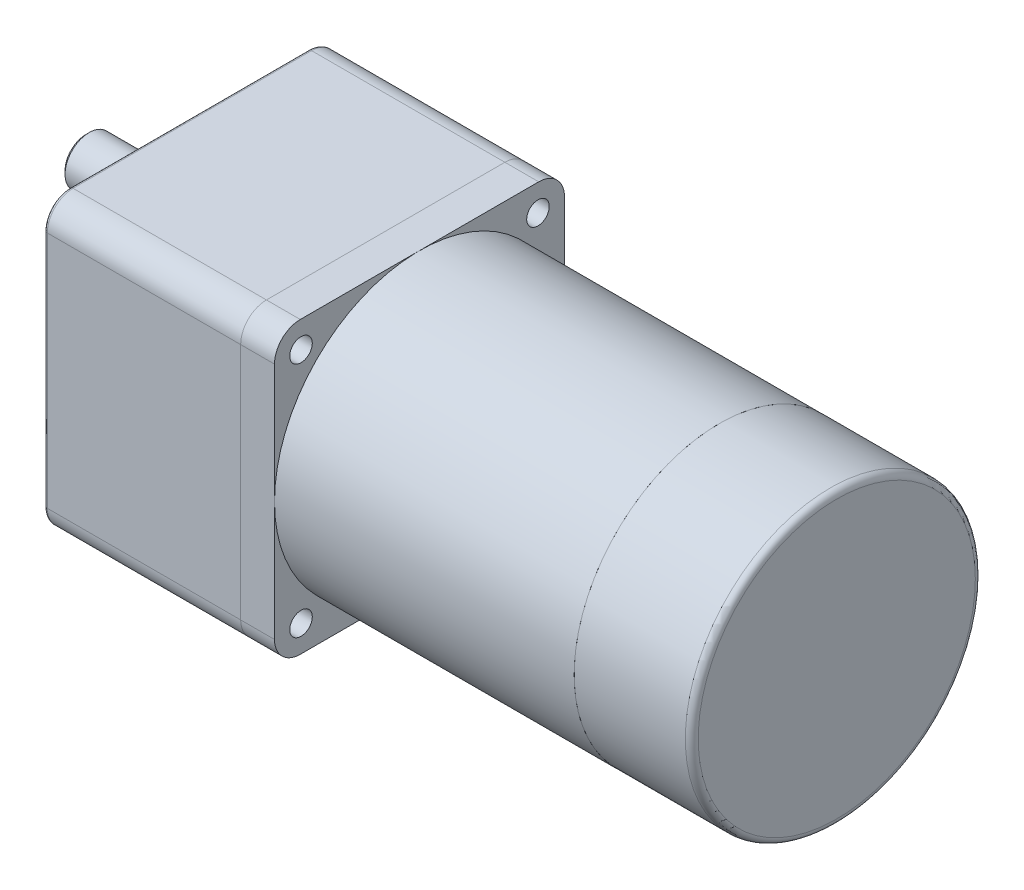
ISO-10303-21;
HEADER;
FILE_DESCRIPTION(('STEP AP214'),'2;1');
FILE_NAME('part.step','',(''),(''),'','','');
FILE_SCHEMA(('AUTOMOTIVE_DESIGN { 1 0 10303 214 1 1 1 1 }'));
ENDSEC;
DATA;
#1=APPLICATION_CONTEXT('core data for automotive mechanical design processes');
#2=APPLICATION_PROTOCOL_DEFINITION('international standard','automotive_design',2000,#1);
#3=PRODUCT_CONTEXT('',#1,'mechanical');
#4=PRODUCT('Part','Part','',(#3));
#5=PRODUCT_RELATED_PRODUCT_CATEGORY('part','',(#4));
#6=PRODUCT_DEFINITION_FORMATION('','',#4);
#7=PRODUCT_DEFINITION_CONTEXT('part definition',#1,'design');
#8=PRODUCT_DEFINITION('design','',#6,#7);
#9=PRODUCT_DEFINITION_SHAPE('','',#8);
#10=(LENGTH_UNIT() NAMED_UNIT(*) SI_UNIT(.MILLI.,.METRE.));
#11=(NAMED_UNIT(*) PLANE_ANGLE_UNIT() SI_UNIT($,.RADIAN.));
#12=(NAMED_UNIT(*) SI_UNIT($,.STERADIAN.) SOLID_ANGLE_UNIT());
#13=UNCERTAINTY_MEASURE_WITH_UNIT(LENGTH_MEASURE(1.E-05),#10,'distance_accuracy_value','');
#14=(GEOMETRIC_REPRESENTATION_CONTEXT(3) GLOBAL_UNCERTAINTY_ASSIGNED_CONTEXT((#13)) GLOBAL_UNIT_ASSIGNED_CONTEXT((#10,
#11,#12)) REPRESENTATION_CONTEXT('',''));
#15=CARTESIAN_POINT('',(0.,0.,0.));
#16=DIRECTION('',(0.,0.,1.));
#17=DIRECTION('',(1.,0.,0.));
#18=AXIS2_PLACEMENT_3D('',#15,#16,#17);
#19=CARTESIAN_POINT('',(201.,0.,0.));
#20=DIRECTION('',(-1.,0.,0.));
#21=DIRECTION('',(0.,0.,1.));
#22=AXIS2_PLACEMENT_3D('',#19,#20,#21);
#23=CYLINDRICAL_SURFACE('',#22,45.);
#24=CARTESIAN_POINT('',(199.,0.,0.));
#25=DIRECTION('',(1.,0.,0.));
#26=DIRECTION('',(0.,0.,-1.));
#27=AXIS2_PLACEMENT_3D('',#24,#25,#26);
#28=CIRCLE('',#27,45.);
#29=CARTESIAN_POINT('',(199.,0.,-45.));
#30=VERTEX_POINT('',#29);
#31=EDGE_CURVE('E11',#30,#30,#28,.F.);
#32=ORIENTED_EDGE('',*,*,#31,.T.);
#33=EDGE_LOOP('',(#32));
#34=FACE_BOUND('',#33,.T.);
#35=CARTESIAN_POINT('',(164.5,0.,0.));
#36=DIRECTION('',(1.,0.,0.));
#37=DIRECTION('',(0.,0.,-1.));
#38=AXIS2_PLACEMENT_3D('',#35,#36,#37);
#39=CIRCLE('',#38,45.);
#40=CARTESIAN_POINT('',(164.5,0.,-45.));
#41=VERTEX_POINT('',#40);
#42=EDGE_CURVE('E55',#41,#41,#39,.T.);
#43=ORIENTED_EDGE('',*,*,#42,.T.);
#44=EDGE_LOOP('',(#43));
#45=FACE_BOUND('',#44,.T.);
#46=ADVANCED_FACE('F44',(#34,#45),#23,.T.);
#47=CARTESIAN_POINT('',(201.,0.,0.));
#48=DIRECTION('',(1.,0.,0.));
#49=DIRECTION('',(0.,0.,-1.));
#50=AXIS2_PLACEMENT_3D('',#47,#48,#49);
#51=PLANE('',#50);
#52=CARTESIAN_POINT('',(201.,0.,0.));
#53=DIRECTION('',(1.,0.,0.));
#54=DIRECTION('',(0.,0.,-1.));
#55=AXIS2_PLACEMENT_3D('',#52,#53,#54);
#56=CIRCLE('',#55,43.);
#57=CARTESIAN_POINT('',(201.,0.,-43.));
#58=VERTEX_POINT('',#57);
#59=EDGE_CURVE('E51',#58,#58,#56,.T.);
#60=ORIENTED_EDGE('',*,*,#59,.T.);
#61=EDGE_LOOP('',(#60));
#62=FACE_BOUND('',#61,.T.);
#63=ADVANCED_FACE('F65',(#62),#51,.T.);
#64=CARTESIAN_POINT('',(164.5,0.,0.));
#65=DIRECTION('',(1.,0.,0.));
#66=DIRECTION('',(0.,0.,-1.));
#67=AXIS2_PLACEMENT_3D('',#64,#65,#66);
#68=PLANE('',#67);
#69=ORIENTED_EDGE('',*,*,#42,.F.);
#70=EDGE_LOOP('',(#69));
#71=FACE_BOUND('',#70,.T.);
#72=ADVANCED_FACE('F63',(#71),#68,.F.);
#73=CARTESIAN_POINT('',(199.,0.,0.));
#74=DIRECTION('',(1.,0.,0.));
#75=DIRECTION('',(0.,0.,-1.));
#76=AXIS2_PLACEMENT_3D('',#73,#74,#75);
#77=TOROIDAL_SURFACE('',#76,43.,2.);
#78=ORIENTED_EDGE('',*,*,#31,.F.);
#79=EDGE_LOOP('',(#78));
#80=FACE_BOUND('',#79,.T.);
#81=ORIENTED_EDGE('',*,*,#59,.F.);
#82=EDGE_LOOP('',(#81));
#83=FACE_BOUND('',#82,.T.);
#84=ADVANCED_FACE('F46',(#80,#83),#77,.T.);
#85=CLOSED_SHELL('',(#46,#63,#72,#84));
#86=MANIFOLD_SOLID_BREP('B2',#85);
#87=CARTESIAN_POINT('',(164.5,0.,0.));
#88=DIRECTION('',(-1.,0.,0.));
#89=DIRECTION('',(0.,0.,1.));
#90=AXIS2_PLACEMENT_3D('',#87,#88,#89);
#91=CYLINDRICAL_SURFACE('',#90,45.);
#92=CARTESIAN_POINT('',(164.5,0.,0.));
#93=DIRECTION('',(1.,0.,0.));
#94=DIRECTION('',(0.,0.,-1.));
#95=AXIS2_PLACEMENT_3D('',#92,#93,#94);
#96=CIRCLE('',#95,45.);
#97=CARTESIAN_POINT('',(164.5,0.,45.));
#98=VERTEX_POINT('',#97);
#99=EDGE_CURVE('E43',#98,#98,#96,.T.);
#100=CARTESIAN_POINT('',(71.5,0.,0.));
#101=DIRECTION('',(1.,0.,0.));
#102=DIRECTION('',(0.,0.,-1.));
#103=AXIS2_PLACEMENT_3D('',#100,#101,#102);
#104=CIRCLE('',#103,45.);
#105=CARTESIAN_POINT('',(71.5,0.,45.));
#106=VERTEX_POINT('',#105);
#107=EDGE_CURVE('E113',#106,#106,#104,.T.);
#108=CARTESIAN_POINT('',(164.5,0.,45.));
#109=CARTESIAN_POINT('',(163.53125,0.,45.));
#110=CARTESIAN_POINT('',(162.5625,0.,45.));
#111=CARTESIAN_POINT('',(160.625,0.,45.));
#112=CARTESIAN_POINT('',(159.65625,0.,45.));
#113=CARTESIAN_POINT('',(157.71875,0.,45.));
#114=CARTESIAN_POINT('',(156.75,0.,45.));
#115=CARTESIAN_POINT('',(154.8125,0.,45.));
#116=CARTESIAN_POINT('',(153.84375,0.,45.));
#117=CARTESIAN_POINT('',(151.90625,0.,45.));
#118=CARTESIAN_POINT('',(150.9375,0.,45.));
#119=CARTESIAN_POINT('',(149.,0.,45.));
#120=CARTESIAN_POINT('',(148.03125,0.,45.));
#121=CARTESIAN_POINT('',(146.09375,0.,45.));
#122=CARTESIAN_POINT('',(145.125,0.,45.));
#123=CARTESIAN_POINT('',(143.1875,0.,45.));
#124=CARTESIAN_POINT('',(142.21875,0.,45.));
#125=CARTESIAN_POINT('',(140.28125,0.,45.));
#126=CARTESIAN_POINT('',(139.3125,0.,45.));
#127=CARTESIAN_POINT('',(137.375,0.,45.));
#128=CARTESIAN_POINT('',(136.40625,0.,45.));
#129=CARTESIAN_POINT('',(134.46875,0.,45.));
#130=CARTESIAN_POINT('',(133.5,0.,45.));
#131=CARTESIAN_POINT('',(131.5625,0.,45.));
#132=CARTESIAN_POINT('',(130.59375,0.,45.));
#133=CARTESIAN_POINT('',(128.65625,0.,45.));
#134=CARTESIAN_POINT('',(127.6875,0.,45.));
#135=CARTESIAN_POINT('',(125.75,0.,45.));
#136=CARTESIAN_POINT('',(124.78125,0.,45.));
#137=CARTESIAN_POINT('',(122.84375,0.,45.));
#138=CARTESIAN_POINT('',(121.875,0.,45.));
#139=CARTESIAN_POINT('',(119.9375,0.,45.));
#140=CARTESIAN_POINT('',(118.96875,0.,45.));
#141=CARTESIAN_POINT('',(117.03125,0.,45.));
#142=CARTESIAN_POINT('',(116.0625,0.,45.));
#143=CARTESIAN_POINT('',(114.125,0.,45.));
#144=CARTESIAN_POINT('',(113.15625,0.,45.));
#145=CARTESIAN_POINT('',(111.21875,0.,45.));
#146=CARTESIAN_POINT('',(110.25,0.,45.));
#147=CARTESIAN_POINT('',(108.3125,0.,45.));
#148=CARTESIAN_POINT('',(107.34375,0.,45.));
#149=CARTESIAN_POINT('',(105.40625,0.,45.));
#150=CARTESIAN_POINT('',(104.4375,0.,45.));
#151=CARTESIAN_POINT('',(102.5,0.,45.));
#152=CARTESIAN_POINT('',(101.53125,0.,45.));
#153=CARTESIAN_POINT('',(99.59375,0.,45.));
#154=CARTESIAN_POINT('',(98.625,0.,45.));
#155=CARTESIAN_POINT('',(96.6875,0.,45.));
#156=CARTESIAN_POINT('',(95.71875,0.,45.));
#157=CARTESIAN_POINT('',(93.78125,0.,45.));
#158=CARTESIAN_POINT('',(92.8125,0.,45.));
#159=CARTESIAN_POINT('',(90.875,0.,45.));
#160=CARTESIAN_POINT('',(89.90625,0.,45.));
#161=CARTESIAN_POINT('',(87.96875,0.,45.));
#162=CARTESIAN_POINT('',(87.,0.,45.));
#163=CARTESIAN_POINT('',(85.0625,0.,45.));
#164=CARTESIAN_POINT('',(84.09375,0.,45.));
#165=CARTESIAN_POINT('',(82.15625,0.,45.));
#166=CARTESIAN_POINT('',(81.1875,0.,45.));
#167=CARTESIAN_POINT('',(79.25,0.,45.));
#168=CARTESIAN_POINT('',(78.28125,0.,45.));
#169=CARTESIAN_POINT('',(76.34375,0.,45.));
#170=CARTESIAN_POINT('',(75.375,0.,45.));
#171=CARTESIAN_POINT('',(73.4375,0.,45.));
#172=CARTESIAN_POINT('',(72.46875,0.,45.));
#173=CARTESIAN_POINT('',(71.5,0.,45.));
#174=B_SPLINE_CURVE_WITH_KNOTS('',3,(#108,#109,#110,#111,#112,#113,#114,#115,#116,#117,#118,
#119,#120,#121,#122,#123,#124,#125,#126,#127,#128,#129,#130,#131,#132,#133,#134,#135,#136,#137,
#138,#139,#140,#141,#142,#143,#144,#145,#146,#147,#148,#149,#150,#151,#152,#153,#154,#155,#156,
#157,#158,#159,#160,#161,#162,#163,#164,#165,#166,#167,#168,#169,#170,#171,#172,#173),
.UNSPECIFIED.,.F.,.F.,(4,2,2,2,2,2,2,2,2,2,2,2,2,2,2,2,2,2,2,2,2,2,2,2,2,2,2,2,2,2,2,2,4),(0.,
2.90625,5.8125,8.71875,11.625,14.53125,17.4375,20.34375,23.25,26.15625,29.0625,31.96875,34.875,
37.78125,40.6875,43.59375,46.5,49.40625,52.3125,55.21875,58.125,61.03125,63.9375,66.84375,69.75,
72.65625,75.5625,78.46875,81.375,84.28125,87.1875,90.09375,93.),.UNSPECIFIED.);
#175=EDGE_CURVE('BSEAM110',#98,#106,#174,.T.);
#176=ORIENTED_EDGE('',*,*,#99,.F.);
#177=ORIENTED_EDGE('',*,*,#107,.T.);
#178=ORIENTED_EDGE('',*,*,#175,.T.);
#179=ORIENTED_EDGE('',*,*,#175,.F.);
#180=EDGE_LOOP('',(#176,#178,#177,#179));
#181=FACE_BOUND('',#180,.T.);
#182=ADVANCED_FACE('F110',(#181),#91,.T.);
#183=CARTESIAN_POINT('',(164.5,0.,0.));
#184=DIRECTION('',(1.,0.,0.));
#185=DIRECTION('',(0.,0.,-1.));
#186=AXIS2_PLACEMENT_3D('',#183,#184,#185);
#187=PLANE('',#186);
#188=ORIENTED_EDGE('',*,*,#99,.T.);
#189=EDGE_LOOP('',(#188));
#190=FACE_BOUND('',#189,.T.);
#191=ADVANCED_FACE('F125',(#190),#187,.T.);
#192=CARTESIAN_POINT('',(71.5,0.,0.));
#193=DIRECTION('',(1.,0.,0.));
#194=DIRECTION('',(0.,0.,-1.));
#195=AXIS2_PLACEMENT_3D('',#192,#193,#194);
#196=PLANE('',#195);
#197=ORIENTED_EDGE('',*,*,#107,.F.);
#198=EDGE_LOOP('',(#197));
#199=FACE_BOUND('',#198,.T.);
#200=ADVANCED_FACE('F123',(#199),#196,.F.);
#201=CLOSED_SHELL('',(#182,#191,#200));
#202=MANIFOLD_SOLID_BREP('B6',#201);
#203=CARTESIAN_POINT('',(-32.,18.,0.));
#204=DIRECTION('',(1.,0.,0.));
#205=DIRECTION('',(0.,0.,-1.));
#206=AXIS2_PLACEMENT_3D('',#203,#204,#205);
#207=CYLINDRICAL_SURFACE('',#206,7.5);
#208=CARTESIAN_POINT('',(-3.,18.,0.));
#209=DIRECTION('',(-1.,0.,0.));
#210=DIRECTION('',(0.,0.,1.));
#211=AXIS2_PLACEMENT_3D('',#208,#209,#210);
#212=CIRCLE('',#211,7.5);
#213=CARTESIAN_POINT('',(-3.,18.,7.5));
#214=VERTEX_POINT('',#213);
#215=EDGE_CURVE('E239',#214,#214,#212,.T.);
#216=ORIENTED_EDGE('',*,*,#215,.T.);
#217=EDGE_LOOP('',(#216));
#218=FACE_BOUND('',#217,.T.);
#219=DIRECTION('',(1.,0.,0.));
#220=VECTOR('',#219,1.);
#221=CARTESIAN_POINT('',(-32.,20.5,-7.07106781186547));
#222=LINE('',#221,#220);
#223=CARTESIAN_POINT('',(-31.,20.5,-7.07106781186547));
#224=VERTEX_POINT('',#223);
#225=CARTESIAN_POINT('',(-9.5,20.5,-7.07106781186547));
#226=VERTEX_POINT('',#225);
#227=EDGE_CURVE('E228',#224,#226,#222,.T.);
#228=ORIENTED_EDGE('',*,*,#227,.F.);
#229=CARTESIAN_POINT('',(-31.,18.,0.));
#230=DIRECTION('',(-1.,0.,0.));
#231=DIRECTION('',(0.,0.,1.));
#232=AXIS2_PLACEMENT_3D('',#229,#230,#231);
#233=CIRCLE('',#232,7.5);
#234=CARTESIAN_POINT('',(-31.,15.5,-7.07106781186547));
#235=VERTEX_POINT('',#234);
#236=EDGE_CURVE('E172',#224,#235,#233,.F.);
#237=ORIENTED_EDGE('',*,*,#236,.T.);
#238=DIRECTION('',(1.,0.,0.));
#239=VECTOR('',#238,1.);
#240=CARTESIAN_POINT('',(-32.,15.5,-7.07106781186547));
#241=LINE('',#240,#239);
#242=CARTESIAN_POINT('',(-9.5,15.5,-7.07106781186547));
#243=VERTEX_POINT('',#242);
#244=EDGE_CURVE('E230',#243,#235,#241,.F.);
#245=ORIENTED_EDGE('',*,*,#244,.F.);
#246=CARTESIAN_POINT('',(-9.5,20.5,-7.07106781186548));
#247=CARTESIAN_POINT('',(-9.43179292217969,20.5000089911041,-7.07105693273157));
#248=CARTESIAN_POINT('',(-9.36359192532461,20.4972088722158,-7.07205443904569));
#249=CARTESIAN_POINT('',(-9.22771896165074,20.4860604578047,-7.07598524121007));
#250=CARTESIAN_POINT('',(-9.16004685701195,20.477713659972,-7.07891801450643));
#251=CARTESIAN_POINT('',(-9.02590951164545,20.455574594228,-7.08662705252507));
#252=CARTESIAN_POINT('',(-8.95944129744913,20.4417984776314,-7.09139784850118));
#253=CARTESIAN_POINT('',(-8.8279917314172,20.4089418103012,-7.10262619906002));
#254=CARTESIAN_POINT('',(-8.7630104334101,20.3898610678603,-7.10908381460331));
#255=CARTESIAN_POINT('',(-8.57103842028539,20.324915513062,-7.13069940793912));
#256=CARTESIAN_POINT('',(-8.44682084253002,20.2713141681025,-7.14811243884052));
#257=CARTESIAN_POINT('',(-8.20912318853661,20.1451778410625,-7.1869703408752));
#258=CARTESIAN_POINT('',(-8.09564976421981,20.0726312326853,-7.20841768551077));
#259=CARTESIAN_POINT('',(-7.8782070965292,19.9076299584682,-7.25386182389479));
#260=CARTESIAN_POINT('',(-7.7747148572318,19.8145628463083,-7.27792189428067));
#261=CARTESIAN_POINT('',(-7.5844828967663,19.6124707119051,-7.32534626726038));
#262=CARTESIAN_POINT('',(-7.497746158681,19.5034428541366,-7.34871044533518));
#263=CARTESIAN_POINT('',(-7.34130177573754,19.2690092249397,-7.39284706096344));
#264=CARTESIAN_POINT('',(-7.27209769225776,19.1432502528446,-7.41353593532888));
#265=CARTESIAN_POINT('',(-7.1560192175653,18.8810730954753,-7.44924021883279));
#266=CARTESIAN_POINT('',(-7.10913800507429,18.7446581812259,-7.46425736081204));
#267=CARTESIAN_POINT('',(-7.04066072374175,18.4700733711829,-7.48647677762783));
#268=CARTESIAN_POINT('',(-7.01824182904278,18.3321295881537,-7.49393272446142));
#269=CARTESIAN_POINT('',(-6.99670924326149,18.0542474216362,-7.50109021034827));
#270=CARTESIAN_POINT('',(-6.99758999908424,17.9143095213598,-7.50079359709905));
#271=CARTESIAN_POINT('',(-7.0221107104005,17.6422403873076,-7.49265096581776));
#272=CARTESIAN_POINT('',(-7.04485659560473,17.5100182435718,-7.48510152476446));
#273=CARTESIAN_POINT('',(-7.1109829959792,17.2513898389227,-7.46367401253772));
#274=CARTESIAN_POINT('',(-7.15436465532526,17.1249839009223,-7.44979559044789));
#275=CARTESIAN_POINT('',(-7.26105342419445,16.8796184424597,-7.41689170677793));
#276=CARTESIAN_POINT('',(-7.32461511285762,16.760778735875,-7.39780094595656));
#277=CARTESIAN_POINT('',(-7.46964987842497,16.5351885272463,-7.35645969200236));
#278=CARTESIAN_POINT('',(-7.55112782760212,16.4284413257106,-7.33420833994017));
#279=CARTESIAN_POINT('',(-7.73417762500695,16.2247566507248,-7.28765679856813));
#280=CARTESIAN_POINT('',(-7.83651385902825,16.128515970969,-7.26330946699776));
#281=CARTESIAN_POINT('',(-8.05610372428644,15.9543199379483,-7.21618726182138));
#282=CARTESIAN_POINT('',(-8.17336215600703,15.8763704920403,-7.19341289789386));
#283=CARTESIAN_POINT('',(-8.42170044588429,15.7399916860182,-7.15175078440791));
#284=CARTESIAN_POINT('',(-8.55295878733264,15.6818674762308,-7.13292537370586));
#285=CARTESIAN_POINT('',(-8.8241174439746,15.5888494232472,-7.10202742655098));
#286=CARTESIAN_POINT('',(-8.96400373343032,15.5539189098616,-7.08994423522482));
#287=CARTESIAN_POINT('',(-9.17104659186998,15.5208546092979,-7.078413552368));
#288=CARTESIAN_POINT('',(-9.23660347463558,15.5130373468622,-7.07566669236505));
#289=CARTESIAN_POINT('',(-9.36809519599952,15.502613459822,-7.07199258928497));
#290=CARTESIAN_POINT('',(-9.43402943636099,15.5000001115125,-7.0710629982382));
#291=CARTESIAN_POINT('',(-9.5,15.5,-7.07106781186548));
#292=B_SPLINE_CURVE_WITH_KNOTS('',3,(#246,#247,#248,#249,#250,#251,#252,#253,#254,#255,#256,
#257,#258,#259,#260,#261,#262,#263,#264,#265,#266,#267,#268,#269,#270,#271,#272,#273,#274,#275,
#276,#277,#278,#279,#280,#281,#282,#283,#284,#285,#286,#287,#288,#289,#290,#291),.UNSPECIFIED.,
.F.,.F.,(4,2,2,2,2,2,2,2,2,2,2,2,2,2,2,2,2,2,2,2,2,2,4),(0.,0.20454621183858,0.409037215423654,
0.612924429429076,0.816819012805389,1.22401016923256,1.63145179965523,2.0532786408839,
2.47518051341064,2.90809434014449,3.34087579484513,3.75860278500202,4.17623021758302,
4.57747647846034,4.97874498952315,5.38529148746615,5.79194868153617,6.21771736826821,
6.64362337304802,7.07581676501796,7.50732520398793,7.70536340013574,7.90314555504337),.UNSPECIFIED.);
#293=EDGE_CURVE('E242',#226,#243,#292,.T.);
#294=ORIENTED_EDGE('',*,*,#293,.F.);
#295=EDGE_LOOP('',(#228,#237,#245,#294));
#296=FACE_BOUND('',#295,.T.);
#297=ADVANCED_FACE('F159',(#218,#296),#207,.T.);
#298=CARTESIAN_POINT('',(-32.,18.,0.));
#299=DIRECTION('',(-1.,0.,0.));
#300=DIRECTION('',(0.,0.,1.));
#301=AXIS2_PLACEMENT_3D('',#298,#299,#300);
#302=PLANE('',#301);
#303=DIRECTION('',(0.,0.,-1.));
#304=VECTOR('',#303,1.);
#305=CARTESIAN_POINT('',(-32.,15.5,-4.5));
#306=LINE('',#305,#304);
#307=CARTESIAN_POINT('',(-32.,15.5,-4.5));
#308=VERTEX_POINT('',#307);
#309=CARTESIAN_POINT('',(-32.,15.5,-6.00000000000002));
#310=VERTEX_POINT('',#309);
#311=EDGE_CURVE('E234',#308,#310,#306,.T.);
#312=ORIENTED_EDGE('',*,*,#311,.T.);
#313=CARTESIAN_POINT('',(-32.,18.,0.));
#314=DIRECTION('',(-1.,0.,0.));
#315=DIRECTION('',(0.,0.,1.));
#316=AXIS2_PLACEMENT_3D('',#313,#314,#315);
#317=CIRCLE('',#316,6.50000000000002);
#318=CARTESIAN_POINT('',(-32.,20.5,-6.00000000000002));
#319=VERTEX_POINT('',#318);
#320=EDGE_CURVE('E248',#310,#319,#317,.T.);
#321=ORIENTED_EDGE('',*,*,#320,.T.);
#322=DIRECTION('',(0.,0.,-1.));
#323=VECTOR('',#322,1.);
#324=CARTESIAN_POINT('',(-32.,20.5,-4.5));
#325=LINE('',#324,#323);
#326=CARTESIAN_POINT('',(-32.,20.5,-4.5));
#327=VERTEX_POINT('',#326);
#328=EDGE_CURVE('E231',#327,#319,#325,.T.);
#329=ORIENTED_EDGE('',*,*,#328,.F.);
#330=DIRECTION('',(0.,-1.,0.));
#331=VECTOR('',#330,1.);
#332=CARTESIAN_POINT('',(-32.,20.5,-4.5));
#333=LINE('',#332,#331);
#334=EDGE_CURVE('E215',#327,#308,#333,.T.);
#335=ORIENTED_EDGE('',*,*,#334,.T.);
#336=EDGE_LOOP('',(#312,#321,#329,#335));
#337=FACE_BOUND('',#336,.T.);
#338=ADVANCED_FACE('F258',(#337),#302,.T.);
#339=CARTESIAN_POINT('',(-3.,18.,0.));
#340=DIRECTION('',(-1.,0.,0.));
#341=DIRECTION('',(0.,0.,1.));
#342=AXIS2_PLACEMENT_3D('',#339,#340,#341);
#343=PLANE('',#342);
#344=ORIENTED_EDGE('',*,*,#215,.F.);
#345=EDGE_LOOP('',(#344));
#346=FACE_BOUND('',#345,.T.);
#347=ADVANCED_FACE('F256',(#346),#343,.F.);
#348=CARTESIAN_POINT('',(-9.5,18.,-4.5));
#349=DIRECTION('',(0.,0.,-1.));
#350=DIRECTION('',(-1.,0.,0.));
#351=AXIS2_PLACEMENT_3D('',#348,#349,#350);
#352=CYLINDRICAL_SURFACE('',#351,2.5);
#353=DIRECTION('',(0.,0.,-1.));
#354=VECTOR('',#353,1.);
#355=CARTESIAN_POINT('',(-9.5,20.5,-4.5));
#356=LINE('',#355,#354);
#357=CARTESIAN_POINT('',(-9.5,20.5,-4.5));
#358=VERTEX_POINT('',#357);
#359=EDGE_CURVE('E223',#358,#226,#356,.T.);
#360=ORIENTED_EDGE('',*,*,#359,.T.);
#361=ORIENTED_EDGE('',*,*,#293,.T.);
#362=DIRECTION('',(0.,0.,-1.));
#363=VECTOR('',#362,1.);
#364=CARTESIAN_POINT('',(-9.5,15.5,-4.5));
#365=LINE('',#364,#363);
#366=CARTESIAN_POINT('',(-9.5,15.5,-4.5));
#367=VERTEX_POINT('',#366);
#368=EDGE_CURVE('E225',#367,#243,#365,.T.);
#369=ORIENTED_EDGE('',*,*,#368,.F.);
#370=CARTESIAN_POINT('',(-9.5,18.,-4.5));
#371=DIRECTION('',(0.,0.,1.));
#372=DIRECTION('',(1.,0.,0.));
#373=AXIS2_PLACEMENT_3D('',#370,#371,#372);
#374=CIRCLE('',#373,2.5);
#375=EDGE_CURVE('E213',#367,#358,#374,.T.);
#376=ORIENTED_EDGE('',*,*,#375,.T.);
#377=EDGE_LOOP('',(#360,#361,#369,#376));
#378=FACE_BOUND('',#377,.T.);
#379=ADVANCED_FACE('F222',(#378),#352,.F.);
#380=CARTESIAN_POINT('',(-9.5,20.5,-4.5));
#381=DIRECTION('',(0.,-1.,0.));
#382=DIRECTION('',(0.,0.,-1.));
#383=AXIS2_PLACEMENT_3D('',#380,#381,#382);
#384=PLANE('',#383);
#385=ORIENTED_EDGE('',*,*,#328,.T.);
#386=CARTESIAN_POINT('',(-32.,20.5,-6.00000000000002));
#387=CARTESIAN_POINT('',(-31.9171731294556,20.5,-6.0897273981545));
#388=CARTESIAN_POINT('',(-31.8341996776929,20.5,-6.17931930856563));
#389=CARTESIAN_POINT('',(-31.6679908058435,20.5,-6.35825867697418));
#390=CARTESIAN_POINT('',(-31.5847553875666,20.5,-6.44760613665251));
#391=CARTESIAN_POINT('',(-31.4180527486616,20.5,-6.62608424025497));
#392=CARTESIAN_POINT('',(-31.3345855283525,20.5,-6.7152148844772));
#393=CARTESIAN_POINT('',(-31.1674427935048,20.5,-6.89328182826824));
#394=CARTESIAN_POINT('',(-31.0837672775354,20.5,-6.98221812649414));
#395=CARTESIAN_POINT('',(-31.,20.5,-7.07106781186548));
#396=B_SPLINE_CURVE_WITH_KNOTS('',3,(#386,#387,#388,#389,#390,#391,#392,#393,#394,#395),
.UNSPECIFIED.,.F.,.F.,(4,2,2,2,4),(0.,0.366335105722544,0.732667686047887,1.0989997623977,
1.46533436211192),.UNSPECIFIED.);
#397=EDGE_CURVE('E186',#319,#224,#396,.T.);
#398=ORIENTED_EDGE('',*,*,#397,.T.);
#399=ORIENTED_EDGE('',*,*,#227,.T.);
#400=ORIENTED_EDGE('',*,*,#359,.F.);
#401=DIRECTION('',(-1.,0.,0.));
#402=VECTOR('',#401,1.);
#403=CARTESIAN_POINT('',(-9.5,20.5,-4.5));
#404=LINE('',#403,#402);
#405=EDGE_CURVE('E210',#358,#327,#404,.T.);
#406=ORIENTED_EDGE('',*,*,#405,.T.);
#407=EDGE_LOOP('',(#385,#398,#399,#400,#406));
#408=FACE_BOUND('',#407,.T.);
#409=ADVANCED_FACE('F227',(#408),#384,.T.);
#410=CARTESIAN_POINT('',(-32.,15.5,-4.5));
#411=DIRECTION('',(0.,1.,0.));
#412=DIRECTION('',(0.,0.,1.));
#413=AXIS2_PLACEMENT_3D('',#410,#411,#412);
#414=PLANE('',#413);
#415=ORIENTED_EDGE('',*,*,#244,.T.);
#416=CARTESIAN_POINT('',(-31.,15.5,-7.07106781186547));
#417=CARTESIAN_POINT('',(-31.0837672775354,15.5,-6.98221812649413));
#418=CARTESIAN_POINT('',(-31.1674427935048,15.5,-6.89328182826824));
#419=CARTESIAN_POINT('',(-31.3345855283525,15.5,-6.7152148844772));
#420=CARTESIAN_POINT('',(-31.4180527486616,15.5,-6.62608424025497));
#421=CARTESIAN_POINT('',(-31.5847553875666,15.5,-6.44760613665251));
#422=CARTESIAN_POINT('',(-31.6679908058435,15.5,-6.35825867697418));
#423=CARTESIAN_POINT('',(-31.8341996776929,15.5,-6.17931930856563));
#424=CARTESIAN_POINT('',(-31.9171731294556,15.5,-6.08972739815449));
#425=CARTESIAN_POINT('',(-32.,15.5,-6.00000000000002));
#426=B_SPLINE_CURVE_WITH_KNOTS('',3,(#416,#417,#418,#419,#420,#421,#422,#423,#424,#425),
.UNSPECIFIED.,.F.,.F.,(4,2,2,2,4),(0.,0.366334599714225,0.732666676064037,1.09899925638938,
1.46533436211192),.UNSPECIFIED.);
#427=EDGE_CURVE('E108',#235,#310,#426,.T.);
#428=ORIENTED_EDGE('',*,*,#427,.T.);
#429=ORIENTED_EDGE('',*,*,#311,.F.);
#430=DIRECTION('',(1.,0.,0.));
#431=VECTOR('',#430,1.);
#432=CARTESIAN_POINT('',(-32.,15.5,-4.5));
#433=LINE('',#432,#431);
#434=EDGE_CURVE('E280',#308,#367,#433,.T.);
#435=ORIENTED_EDGE('',*,*,#434,.T.);
#436=ORIENTED_EDGE('',*,*,#368,.T.);
#437=EDGE_LOOP('',(#415,#428,#429,#435,#436));
#438=FACE_BOUND('',#437,.T.);
#439=ADVANCED_FACE('F284',(#438),#414,.T.);
#440=CARTESIAN_POINT('',(-9.5,18.,-4.5));
#441=DIRECTION('',(0.,0.,1.));
#442=DIRECTION('',(1.,0.,0.));
#443=AXIS2_PLACEMENT_3D('',#440,#441,#442);
#444=PLANE('',#443);
#445=ORIENTED_EDGE('',*,*,#375,.F.);
#446=ORIENTED_EDGE('',*,*,#434,.F.);
#447=ORIENTED_EDGE('',*,*,#334,.F.);
#448=ORIENTED_EDGE('',*,*,#405,.F.);
#449=EDGE_LOOP('',(#445,#446,#447,#448));
#450=FACE_BOUND('',#449,.T.);
#451=ADVANCED_FACE('F212',(#450),#444,.F.);
#452=CARTESIAN_POINT('',(-32.,18.,0.));
#453=DIRECTION('',(1.,0.,0.));
#454=DIRECTION('',(0.,0.,-1.));
#455=AXIS2_PLACEMENT_3D('',#452,#453,#454);
#456=CONICAL_SURFACE('',#455,6.50000000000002,0.785398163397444);
#457=ORIENTED_EDGE('',*,*,#427,.F.);
#458=ORIENTED_EDGE('',*,*,#236,.F.);
#459=ORIENTED_EDGE('',*,*,#397,.F.);
#460=ORIENTED_EDGE('',*,*,#320,.F.);
#461=EDGE_LOOP('',(#457,#458,#459,#460));
#462=FACE_BOUND('',#461,.T.);
#463=ADVANCED_FACE('F161',(#462),#456,.T.);
#464=CLOSED_SHELL('',(#297,#338,#347,#379,#409,#439,#451,#463));
#465=MANIFOLD_SOLID_BREP('B38',#464);
#466=CARTESIAN_POINT('',(-3.,18.,0.));
#467=DIRECTION('',(1.,0.,0.));
#468=DIRECTION('',(0.,0.,-1.));
#469=AXIS2_PLACEMENT_3D('',#466,#467,#468);
#470=CYLINDRICAL_SURFACE('',#469,16.);
#471=CARTESIAN_POINT('',(-2.5,18.,0.));
#472=DIRECTION('',(-1.,0.,0.));
#473=DIRECTION('',(0.,0.,1.));
#474=AXIS2_PLACEMENT_3D('',#471,#472,#473);
#475=CIRCLE('',#474,16.);
#476=CARTESIAN_POINT('',(-2.5,18.,16.));
#477=VERTEX_POINT('',#476);
#478=EDGE_CURVE('E158',#477,#477,#475,.F.);
#479=ORIENTED_EDGE('',*,*,#478,.T.);
#480=EDGE_LOOP('',(#479));
#481=FACE_BOUND('',#480,.T.);
#482=CARTESIAN_POINT('',(0.,18.,0.));
#483=DIRECTION('',(-1.,0.,0.));
#484=DIRECTION('',(0.,0.,1.));
#485=AXIS2_PLACEMENT_3D('',#482,#483,#484);
#486=CIRCLE('',#485,16.);
#487=CARTESIAN_POINT('',(0.,18.,16.));
#488=VERTEX_POINT('',#487);
#489=EDGE_CURVE('E360',#488,#488,#486,.T.);
#490=ORIENTED_EDGE('',*,*,#489,.T.);
#491=EDGE_LOOP('',(#490));
#492=FACE_BOUND('',#491,.T.);
#493=ADVANCED_FACE('F349',(#481,#492),#470,.T.);
#494=CARTESIAN_POINT('',(-3.,18.,0.));
#495=DIRECTION('',(-1.,0.,0.));
#496=DIRECTION('',(0.,0.,1.));
#497=AXIS2_PLACEMENT_3D('',#494,#495,#496);
#498=PLANE('',#497);
#499=CARTESIAN_POINT('',(-3.,18.,0.));
#500=DIRECTION('',(-1.,0.,0.));
#501=DIRECTION('',(0.,0.,1.));
#502=AXIS2_PLACEMENT_3D('',#499,#500,#501);
#503=CIRCLE('',#502,15.5);
#504=CARTESIAN_POINT('',(-3.,18.,15.5));
#505=VERTEX_POINT('',#504);
#506=EDGE_CURVE('E356',#505,#505,#503,.T.);
#507=ORIENTED_EDGE('',*,*,#506,.T.);
#508=EDGE_LOOP('',(#507));
#509=FACE_BOUND('',#508,.T.);
#510=ADVANCED_FACE('F370',(#509),#498,.T.);
#511=CARTESIAN_POINT('',(0.,18.,0.));
#512=DIRECTION('',(-1.,0.,0.));
#513=DIRECTION('',(0.,0.,1.));
#514=AXIS2_PLACEMENT_3D('',#511,#512,#513);
#515=PLANE('',#514);
#516=ORIENTED_EDGE('',*,*,#489,.F.);
#517=EDGE_LOOP('',(#516));
#518=FACE_BOUND('',#517,.T.);
#519=ADVANCED_FACE('F368',(#518),#515,.F.);
#520=CARTESIAN_POINT('',(-2.5,18.,0.));
#521=DIRECTION('',(-1.,0.,0.));
#522=DIRECTION('',(0.,0.,1.));
#523=AXIS2_PLACEMENT_3D('',#520,#521,#522);
#524=TOROIDAL_SURFACE('',#523,15.5,0.5);
#525=ORIENTED_EDGE('',*,*,#478,.F.);
#526=EDGE_LOOP('',(#525));
#527=FACE_BOUND('',#526,.T.);
#528=ORIENTED_EDGE('',*,*,#506,.F.);
#529=EDGE_LOOP('',(#528));
#530=FACE_BOUND('',#529,.T.);
#531=ADVANCED_FACE('F351',(#527,#530),#524,.T.);
#532=CLOSED_SHELL('',(#493,#510,#519,#531));
#533=MANIFOLD_SOLID_BREP('B102',#532);
#534=CARTESIAN_POINT('',(71.5,37.,-37.));
#535=DIRECTION('',(-1.,0.,0.));
#536=DIRECTION('',(0.,0.,1.));
#537=AXIS2_PLACEMENT_3D('',#534,#535,#536);
#538=CYLINDRICAL_SURFACE('',#537,8.);
#539=CARTESIAN_POINT('',(61.,37.,-37.));
#540=DIRECTION('',(1.,0.,0.));
#541=DIRECTION('',(0.,0.,1.));
#542=AXIS2_PLACEMENT_3D('',#539,#540,#541);
#543=CIRCLE('',#542,8.);
#544=CARTESIAN_POINT('',(61.,37.,-45.));
#545=VERTEX_POINT('',#544);
#546=CARTESIAN_POINT('',(61.,45.,-36.9999999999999));
#547=VERTEX_POINT('',#546);
#548=EDGE_CURVE('E512',#545,#547,#543,.T.);
#549=ORIENTED_EDGE('',*,*,#548,.T.);
#550=DIRECTION('',(-1.,0.,0.));
#551=VECTOR('',#550,1.);
#552=CARTESIAN_POINT('',(71.5,45.,-36.9999999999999));
#553=LINE('',#552,#551);
#554=CARTESIAN_POINT('',(71.5,45.,-36.9999999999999));
#555=VERTEX_POINT('',#554);
#556=EDGE_CURVE('E347',#555,#547,#553,.T.);
#557=ORIENTED_EDGE('',*,*,#556,.F.);
#558=CARTESIAN_POINT('',(71.5,37.,-37.));
#559=DIRECTION('',(1.,0.,0.));
#560=DIRECTION('',(0.,0.,1.));
#561=AXIS2_PLACEMENT_3D('',#558,#559,#560);
#562=CIRCLE('',#561,8.);
#563=CARTESIAN_POINT('',(71.5,37.,-45.));
#564=VERTEX_POINT('',#563);
#565=EDGE_CURVE('E526',#564,#555,#562,.T.);
#566=ORIENTED_EDGE('',*,*,#565,.F.);
#567=DIRECTION('',(-1.,0.,0.));
#568=VECTOR('',#567,1.);
#569=CARTESIAN_POINT('',(71.5,37.,-45.));
#570=LINE('',#569,#568);
#571=EDGE_CURVE('E508',#564,#545,#570,.T.);
#572=ORIENTED_EDGE('',*,*,#571,.T.);
#573=EDGE_LOOP('',(#549,#557,#566,#572));
#574=FACE_BOUND('',#573,.T.);
#575=ADVANCED_FACE('F414',(#574),#538,.T.);
#576=CARTESIAN_POINT('',(71.5,45.,36.9999999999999));
#577=DIRECTION('',(0.,-1.,0.));
#578=DIRECTION('',(0.,0.,-1.));
#579=AXIS2_PLACEMENT_3D('',#576,#577,#578);
#580=PLANE('',#579);
#581=DIRECTION('',(0.,0.,1.));
#582=VECTOR('',#581,1.);
#583=CARTESIAN_POINT('',(61.,45.,36.9999999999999));
#584=LINE('',#583,#582);
#585=CARTESIAN_POINT('',(61.,45.,36.9999999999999));
#586=VERTEX_POINT('',#585);
#587=EDGE_CURVE('E515',#547,#586,#584,.T.);
#588=ORIENTED_EDGE('',*,*,#587,.T.);
#589=DIRECTION('',(-1.,0.,0.));
#590=VECTOR('',#589,1.);
#591=CARTESIAN_POINT('',(71.5,45.,36.9999999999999));
#592=LINE('',#591,#590);
#593=CARTESIAN_POINT('',(71.5,45.,36.9999999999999));
#594=VERTEX_POINT('',#593);
#595=EDGE_CURVE('E423',#594,#586,#592,.T.);
#596=ORIENTED_EDGE('',*,*,#595,.F.);
#597=DIRECTION('',(0.,0.,1.));
#598=VECTOR('',#597,1.);
#599=CARTESIAN_POINT('',(71.5,45.,36.9999999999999));
#600=LINE('',#599,#598);
#601=EDGE_CURVE('E475',#555,#594,#600,.T.);
#602=ORIENTED_EDGE('',*,*,#601,.F.);
#603=ORIENTED_EDGE('',*,*,#556,.T.);
#604=EDGE_LOOP('',(#588,#596,#602,#603));
#605=FACE_BOUND('',#604,.T.);
#606=ADVANCED_FACE('F580',(#605),#580,.F.);
#607=CARTESIAN_POINT('',(71.5,37.,37.));
#608=DIRECTION('',(-1.,0.,0.));
#609=DIRECTION('',(0.,0.,1.));
#610=AXIS2_PLACEMENT_3D('',#607,#608,#609);
#611=CYLINDRICAL_SURFACE('',#610,8.);
#612=CARTESIAN_POINT('',(61.,37.,37.));
#613=DIRECTION('',(1.,0.,0.));
#614=DIRECTION('',(0.,0.,1.));
#615=AXIS2_PLACEMENT_3D('',#612,#613,#614);
#616=CIRCLE('',#615,8.);
#617=CARTESIAN_POINT('',(61.,37.,45.));
#618=VERTEX_POINT('',#617);
#619=EDGE_CURVE('E517',#586,#618,#616,.T.);
#620=ORIENTED_EDGE('',*,*,#619,.T.);
#621=DIRECTION('',(-1.,0.,0.));
#622=VECTOR('',#621,1.);
#623=CARTESIAN_POINT('',(71.5,37.,45.));
#624=LINE('',#623,#622);
#625=CARTESIAN_POINT('',(71.5,37.,45.));
#626=VERTEX_POINT('',#625);
#627=EDGE_CURVE('E533',#626,#618,#624,.T.);
#628=ORIENTED_EDGE('',*,*,#627,.F.);
#629=CARTESIAN_POINT('',(71.5,37.,37.));
#630=DIRECTION('',(1.,0.,0.));
#631=DIRECTION('',(0.,0.,1.));
#632=AXIS2_PLACEMENT_3D('',#629,#630,#631);
#633=CIRCLE('',#632,8.);
#634=EDGE_CURVE('E681',#594,#626,#633,.T.);
#635=ORIENTED_EDGE('',*,*,#634,.F.);
#636=ORIENTED_EDGE('',*,*,#595,.T.);
#637=EDGE_LOOP('',(#620,#628,#635,#636));
#638=FACE_BOUND('',#637,.T.);
#639=ADVANCED_FACE('F584',(#638),#611,.T.);
#640=CARTESIAN_POINT('',(71.5,-37.,45.));
#641=DIRECTION('',(0.,0.,-1.));
#642=DIRECTION('',(-1.,0.,0.));
#643=AXIS2_PLACEMENT_3D('',#640,#641,#642);
#644=PLANE('',#643);
#645=DIRECTION('',(0.,-1.,0.));
#646=VECTOR('',#645,1.);
#647=CARTESIAN_POINT('',(61.,-37.,45.));
#648=LINE('',#647,#646);
#649=CARTESIAN_POINT('',(61.,-37.,45.));
#650=VERTEX_POINT('',#649);
#651=EDGE_CURVE('E519',#618,#650,#648,.T.);
#652=ORIENTED_EDGE('',*,*,#651,.T.);
#653=DIRECTION('',(-1.,0.,0.));
#654=VECTOR('',#653,1.);
#655=CARTESIAN_POINT('',(71.5,-37.,45.));
#656=LINE('',#655,#654);
#657=CARTESIAN_POINT('',(71.5,-37.,45.));
#658=VERTEX_POINT('',#657);
#659=EDGE_CURVE('E530',#658,#650,#656,.T.);
#660=ORIENTED_EDGE('',*,*,#659,.F.);
#661=DIRECTION('',(0.,-1.,0.));
#662=VECTOR('',#661,1.);
#663=CARTESIAN_POINT('',(71.5,-37.,45.));
#664=LINE('',#663,#662);
#665=EDGE_CURVE('E683',#626,#658,#664,.T.);
#666=ORIENTED_EDGE('',*,*,#665,.F.);
#667=ORIENTED_EDGE('',*,*,#627,.T.);
#668=EDGE_LOOP('',(#652,#660,#666,#667));
#669=FACE_BOUND('',#668,.T.);
#670=ADVANCED_FACE('F588',(#669),#644,.F.);
#671=CARTESIAN_POINT('',(71.5,-37.,37.));
#672=DIRECTION('',(-1.,0.,0.));
#673=DIRECTION('',(0.,0.,1.));
#674=AXIS2_PLACEMENT_3D('',#671,#672,#673);
#675=CYLINDRICAL_SURFACE('',#674,8.);
#676=CARTESIAN_POINT('',(61.,-37.,37.));
#677=DIRECTION('',(1.,0.,0.));
#678=DIRECTION('',(0.,0.,1.));
#679=AXIS2_PLACEMENT_3D('',#676,#677,#678);
#680=CIRCLE('',#679,8.);
#681=CARTESIAN_POINT('',(61.,-45.,36.9999999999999));
#682=VERTEX_POINT('',#681);
#683=EDGE_CURVE('E521',#650,#682,#680,.T.);
#684=ORIENTED_EDGE('',*,*,#683,.T.);
#685=DIRECTION('',(-1.,0.,0.));
#686=VECTOR('',#685,1.);
#687=CARTESIAN_POINT('',(71.5,-45.,36.9999999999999));
#688=LINE('',#687,#686);
#689=CARTESIAN_POINT('',(71.5,-45.,36.9999999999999));
#690=VERTEX_POINT('',#689);
#691=EDGE_CURVE('E503',#690,#682,#688,.T.);
#692=ORIENTED_EDGE('',*,*,#691,.F.);
#693=CARTESIAN_POINT('',(71.5,-37.,37.));
#694=DIRECTION('',(1.,0.,0.));
#695=DIRECTION('',(0.,0.,1.));
#696=AXIS2_PLACEMENT_3D('',#693,#694,#695);
#697=CIRCLE('',#696,8.);
#698=EDGE_CURVE('E494',#658,#690,#697,.T.);
#699=ORIENTED_EDGE('',*,*,#698,.F.);
#700=ORIENTED_EDGE('',*,*,#659,.T.);
#701=EDGE_LOOP('',(#684,#692,#699,#700));
#702=FACE_BOUND('',#701,.T.);
#703=ADVANCED_FACE('F594',(#702),#675,.T.);
#704=CARTESIAN_POINT('',(71.5,-45.,36.9999999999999));
#705=DIRECTION('',(0.,1.,0.));
#706=DIRECTION('',(0.,0.,1.));
#707=AXIS2_PLACEMENT_3D('',#704,#705,#706);
#708=PLANE('',#707);
#709=DIRECTION('',(0.,0.,-1.));
#710=VECTOR('',#709,1.);
#711=CARTESIAN_POINT('',(61.,-45.,36.9999999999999));
#712=LINE('',#711,#710);
#713=CARTESIAN_POINT('',(61.,-45.,-36.9999999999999));
#714=VERTEX_POINT('',#713);
#715=EDGE_CURVE('E502',#682,#714,#712,.T.);
#716=ORIENTED_EDGE('',*,*,#715,.T.);
#717=DIRECTION('',(-1.,0.,0.));
#718=VECTOR('',#717,1.);
#719=CARTESIAN_POINT('',(71.5,-45.,-36.9999999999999));
#720=LINE('',#719,#718);
#721=CARTESIAN_POINT('',(71.5,-45.,-36.9999999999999));
#722=VERTEX_POINT('',#721);
#723=EDGE_CURVE('E499',#722,#714,#720,.T.);
#724=ORIENTED_EDGE('',*,*,#723,.F.);
#725=DIRECTION('',(0.,0.,-1.));
#726=VECTOR('',#725,1.);
#727=CARTESIAN_POINT('',(71.5,-45.,36.9999999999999));
#728=LINE('',#727,#726);
#729=EDGE_CURVE('E488',#690,#722,#728,.T.);
#730=ORIENTED_EDGE('',*,*,#729,.F.);
#731=ORIENTED_EDGE('',*,*,#691,.T.);
#732=EDGE_LOOP('',(#716,#724,#730,#731));
#733=FACE_BOUND('',#732,.T.);
#734=ADVANCED_FACE('F500',(#733),#708,.F.);
#735=CARTESIAN_POINT('',(71.5,-37.,-37.));
#736=DIRECTION('',(-1.,0.,0.));
#737=DIRECTION('',(0.,0.,1.));
#738=AXIS2_PLACEMENT_3D('',#735,#736,#737);
#739=CYLINDRICAL_SURFACE('',#738,8.);
#740=CARTESIAN_POINT('',(61.,-37.,-37.));
#741=DIRECTION('',(1.,0.,0.));
#742=DIRECTION('',(0.,0.,-1.));
#743=AXIS2_PLACEMENT_3D('',#740,#741,#742);
#744=CIRCLE('',#743,8.);
#745=CARTESIAN_POINT('',(61.,-37.,-45.));
#746=VERTEX_POINT('',#745);
#747=EDGE_CURVE('E461',#714,#746,#744,.T.);
#748=ORIENTED_EDGE('',*,*,#747,.T.);
#749=DIRECTION('',(-1.,0.,0.));
#750=VECTOR('',#749,1.);
#751=CARTESIAN_POINT('',(71.5,-37.,-45.));
#752=LINE('',#751,#750);
#753=CARTESIAN_POINT('',(71.5,-37.,-45.));
#754=VERTEX_POINT('',#753);
#755=EDGE_CURVE('E504',#754,#746,#752,.T.);
#756=ORIENTED_EDGE('',*,*,#755,.F.);
#757=CARTESIAN_POINT('',(71.5,-37.,-37.));
#758=DIRECTION('',(1.,0.,0.));
#759=DIRECTION('',(0.,0.,-1.));
#760=AXIS2_PLACEMENT_3D('',#757,#758,#759);
#761=CIRCLE('',#760,8.);
#762=EDGE_CURVE('E492',#722,#754,#761,.T.);
#763=ORIENTED_EDGE('',*,*,#762,.F.);
#764=ORIENTED_EDGE('',*,*,#723,.T.);
#765=EDGE_LOOP('',(#748,#756,#763,#764));
#766=FACE_BOUND('',#765,.T.);
#767=ADVANCED_FACE('F506',(#766),#739,.T.);
#768=CARTESIAN_POINT('',(71.5,-37.,-45.));
#769=DIRECTION('',(0.,0.,1.));
#770=DIRECTION('',(1.,0.,0.));
#771=AXIS2_PLACEMENT_3D('',#768,#769,#770);
#772=PLANE('',#771);
#773=DIRECTION('',(0.,1.,0.));
#774=VECTOR('',#773,1.);
#775=CARTESIAN_POINT('',(61.,-37.,-45.));
#776=LINE('',#775,#774);
#777=EDGE_CURVE('E467',#746,#545,#776,.T.);
#778=ORIENTED_EDGE('',*,*,#777,.T.);
#779=ORIENTED_EDGE('',*,*,#571,.F.);
#780=DIRECTION('',(0.,1.,0.));
#781=VECTOR('',#780,1.);
#782=CARTESIAN_POINT('',(71.5,-37.,-45.));
#783=LINE('',#782,#781);
#784=EDGE_CURVE('E432',#754,#564,#783,.T.);
#785=ORIENTED_EDGE('',*,*,#784,.F.);
#786=ORIENTED_EDGE('',*,*,#755,.T.);
#787=EDGE_LOOP('',(#778,#779,#785,#786));
#788=FACE_BOUND('',#787,.T.);
#789=ADVANCED_FACE('F569',(#788),#772,.F.);
#790=CARTESIAN_POINT('',(71.5,37.,-37.));
#791=DIRECTION('',(-1.,0.,0.));
#792=DIRECTION('',(0.,0.,1.));
#793=AXIS2_PLACEMENT_3D('',#790,#791,#792);
#794=PLANE('',#793);
#795=CARTESIAN_POINT('',(71.5,36.7695526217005,36.7695526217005));
#796=DIRECTION('',(1.,0.,0.));
#797=DIRECTION('',(0.,0.,-1.));
#798=AXIS2_PLACEMENT_3D('',#795,#796,#797);
#799=CIRCLE('',#798,3.5);
#800=CARTESIAN_POINT('',(71.5,36.7695526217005,33.2695526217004));
#801=VERTEX_POINT('',#800);
#802=EDGE_CURVE('E542',#801,#801,#799,.T.);
#803=ORIENTED_EDGE('',*,*,#802,.F.);
#804=EDGE_LOOP('',(#803));
#805=FACE_BOUND('',#804,.T.);
#806=CARTESIAN_POINT('',(71.5,36.7695526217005,-36.7695526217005));
#807=DIRECTION('',(1.,0.,0.));
#808=DIRECTION('',(0.,0.,-1.));
#809=AXIS2_PLACEMENT_3D('',#806,#807,#808);
#810=CIRCLE('',#809,3.5);
#811=CARTESIAN_POINT('',(71.5,36.7695526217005,-40.2695526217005));
#812=VERTEX_POINT('',#811);
#813=EDGE_CURVE('E667',#812,#812,#810,.T.);
#814=ORIENTED_EDGE('',*,*,#813,.F.);
#815=EDGE_LOOP('',(#814));
#816=FACE_BOUND('',#815,.T.);
#817=CARTESIAN_POINT('',(71.5,-36.7695526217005,-36.7695526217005));
#818=DIRECTION('',(1.,0.,0.));
#819=DIRECTION('',(0.,0.,-1.));
#820=AXIS2_PLACEMENT_3D('',#817,#818,#819);
#821=CIRCLE('',#820,3.5);
#822=CARTESIAN_POINT('',(71.5,-36.7695526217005,-40.2695526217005));
#823=VERTEX_POINT('',#822);
#824=EDGE_CURVE('E669',#823,#823,#821,.T.);
#825=ORIENTED_EDGE('',*,*,#824,.F.);
#826=EDGE_LOOP('',(#825));
#827=FACE_BOUND('',#826,.T.);
#828=CARTESIAN_POINT('',(71.5,-36.7695526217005,36.7695526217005));
#829=DIRECTION('',(1.,0.,0.));
#830=DIRECTION('',(0.,0.,-1.));
#831=AXIS2_PLACEMENT_3D('',#828,#829,#830);
#832=CIRCLE('',#831,3.5);
#833=CARTESIAN_POINT('',(71.5,-36.7695526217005,33.2695526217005));
#834=VERTEX_POINT('',#833);
#835=EDGE_CURVE('E674',#834,#834,#832,.T.);
#836=ORIENTED_EDGE('',*,*,#835,.F.);
#837=EDGE_LOOP('',(#836));
#838=FACE_BOUND('',#837,.T.);
#839=ORIENTED_EDGE('',*,*,#565,.T.);
#840=ORIENTED_EDGE('',*,*,#601,.T.);
#841=ORIENTED_EDGE('',*,*,#634,.T.);
#842=ORIENTED_EDGE('',*,*,#665,.T.);
#843=ORIENTED_EDGE('',*,*,#698,.T.);
#844=ORIENTED_EDGE('',*,*,#729,.T.);
#845=ORIENTED_EDGE('',*,*,#762,.T.);
#846=ORIENTED_EDGE('',*,*,#784,.T.);
#847=EDGE_LOOP('',(#839,#840,#841,#842,#843,#844,#845,#846));
#848=FACE_BOUND('',#847,.T.);
#849=ADVANCED_FACE('F490',(#805,#816,#827,#838,#848),#794,.F.);
#850=CARTESIAN_POINT('',(61.,37.,-37.));
#851=DIRECTION('',(-1.,0.,0.));
#852=DIRECTION('',(0.,0.,1.));
#853=AXIS2_PLACEMENT_3D('',#850,#851,#852);
#854=PLANE('',#853);
#855=CARTESIAN_POINT('',(61.,36.7695526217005,36.7695526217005));
#856=DIRECTION('',(-1.,0.,0.));
#857=DIRECTION('',(0.,0.,1.));
#858=AXIS2_PLACEMENT_3D('',#855,#856,#857);
#859=CIRCLE('',#858,3.5);
#860=CARTESIAN_POINT('',(61.,36.7695526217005,40.2695526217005));
#861=VERTEX_POINT('',#860);
#862=EDGE_CURVE('E417',#861,#861,#859,.T.);
#863=ORIENTED_EDGE('',*,*,#862,.F.);
#864=EDGE_LOOP('',(#863));
#865=FACE_BOUND('',#864,.T.);
#866=CARTESIAN_POINT('',(61.,36.7695526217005,-36.7695526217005));
#867=DIRECTION('',(-1.,0.,0.));
#868=DIRECTION('',(0.,0.,1.));
#869=AXIS2_PLACEMENT_3D('',#866,#867,#868);
#870=CIRCLE('',#869,3.5);
#871=CARTESIAN_POINT('',(61.,36.7695526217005,-33.2695526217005));
#872=VERTEX_POINT('',#871);
#873=EDGE_CURVE('E544',#872,#872,#870,.T.);
#874=ORIENTED_EDGE('',*,*,#873,.F.);
#875=EDGE_LOOP('',(#874));
#876=FACE_BOUND('',#875,.T.);
#877=CARTESIAN_POINT('',(61.,-36.7695526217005,-36.7695526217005));
#878=DIRECTION('',(-1.,0.,0.));
#879=DIRECTION('',(0.,0.,1.));
#880=AXIS2_PLACEMENT_3D('',#877,#878,#879);
#881=CIRCLE('',#880,3.5);
#882=CARTESIAN_POINT('',(61.,-36.7695526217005,-33.2695526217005));
#883=VERTEX_POINT('',#882);
#884=EDGE_CURVE('E541',#883,#883,#881,.T.);
#885=ORIENTED_EDGE('',*,*,#884,.F.);
#886=EDGE_LOOP('',(#885));
#887=FACE_BOUND('',#886,.T.);
#888=CARTESIAN_POINT('',(61.,-36.7695526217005,36.7695526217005));
#889=DIRECTION('',(-1.,0.,0.));
#890=DIRECTION('',(0.,0.,1.));
#891=AXIS2_PLACEMENT_3D('',#888,#889,#890);
#892=CIRCLE('',#891,3.5);
#893=CARTESIAN_POINT('',(61.,-36.7695526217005,40.2695526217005));
#894=VERTEX_POINT('',#893);
#895=EDGE_CURVE('E538',#894,#894,#892,.T.);
#896=ORIENTED_EDGE('',*,*,#895,.F.);
#897=EDGE_LOOP('',(#896));
#898=FACE_BOUND('',#897,.T.);
#899=ORIENTED_EDGE('',*,*,#548,.F.);
#900=ORIENTED_EDGE('',*,*,#777,.F.);
#901=ORIENTED_EDGE('',*,*,#747,.F.);
#902=ORIENTED_EDGE('',*,*,#715,.F.);
#903=ORIENTED_EDGE('',*,*,#683,.F.);
#904=ORIENTED_EDGE('',*,*,#651,.F.);
#905=ORIENTED_EDGE('',*,*,#619,.F.);
#906=ORIENTED_EDGE('',*,*,#587,.F.);
#907=EDGE_LOOP('',(#899,#900,#901,#902,#903,#904,#905,#906));
#908=FACE_BOUND('',#907,.T.);
#909=ADVANCED_FACE('F554',(#865,#876,#887,#898,#908),#854,.T.);
#910=CARTESIAN_POINT('',(9.49999999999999,-36.7695526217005,36.7695526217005));
#911=DIRECTION('',(1.,0.,0.));
#912=DIRECTION('',(0.,0.,-1.));
#913=AXIS2_PLACEMENT_3D('',#910,#911,#912);
#914=CYLINDRICAL_SURFACE('',#913,3.5);
#915=ORIENTED_EDGE('',*,*,#895,.T.);
#916=EDGE_LOOP('',(#915));
#917=FACE_BOUND('',#916,.T.);
#918=ORIENTED_EDGE('',*,*,#835,.T.);
#919=EDGE_LOOP('',(#918));
#920=FACE_BOUND('',#919,.T.);
#921=ADVANCED_FACE('F557',(#917,#920),#914,.F.);
#922=CARTESIAN_POINT('',(9.49999999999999,-36.7695526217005,-36.7695526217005));
#923=DIRECTION('',(1.,0.,0.));
#924=DIRECTION('',(0.,0.,-1.));
#925=AXIS2_PLACEMENT_3D('',#922,#923,#924);
#926=CYLINDRICAL_SURFACE('',#925,3.5);
#927=ORIENTED_EDGE('',*,*,#884,.T.);
#928=EDGE_LOOP('',(#927));
#929=FACE_BOUND('',#928,.T.);
#930=ORIENTED_EDGE('',*,*,#824,.T.);
#931=EDGE_LOOP('',(#930));
#932=FACE_BOUND('',#931,.T.);
#933=ADVANCED_FACE('F633',(#929,#932),#926,.F.);
#934=CARTESIAN_POINT('',(9.49999999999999,36.7695526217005,-36.7695526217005));
#935=DIRECTION('',(1.,0.,0.));
#936=DIRECTION('',(0.,0.,-1.));
#937=AXIS2_PLACEMENT_3D('',#934,#935,#936);
#938=CYLINDRICAL_SURFACE('',#937,3.5);
#939=ORIENTED_EDGE('',*,*,#873,.T.);
#940=EDGE_LOOP('',(#939));
#941=FACE_BOUND('',#940,.T.);
#942=ORIENTED_EDGE('',*,*,#813,.T.);
#943=EDGE_LOOP('',(#942));
#944=FACE_BOUND('',#943,.T.);
#945=ADVANCED_FACE('F643',(#941,#944),#938,.F.);
#946=CARTESIAN_POINT('',(9.49999999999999,36.7695526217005,36.7695526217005));
#947=DIRECTION('',(1.,0.,0.));
#948=DIRECTION('',(0.,0.,-1.));
#949=AXIS2_PLACEMENT_3D('',#946,#947,#948);
#950=CYLINDRICAL_SURFACE('',#949,3.5);
#951=ORIENTED_EDGE('',*,*,#862,.T.);
#952=EDGE_LOOP('',(#951));
#953=FACE_BOUND('',#952,.T.);
#954=ORIENTED_EDGE('',*,*,#802,.T.);
#955=EDGE_LOOP('',(#954));
#956=FACE_BOUND('',#955,.T.);
#957=ADVANCED_FACE('F551',(#953,#956),#950,.F.);
#958=CLOSED_SHELL('',(#575,#606,#639,#670,#703,#734,#767,#789,#849,#909,#921,#933,#945,#957));
#959=MANIFOLD_SOLID_BREP('B153',#958);
#960=CARTESIAN_POINT('',(0.,-36.7695526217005,-36.7695526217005));
#961=DIRECTION('',(-1.,0.,0.));
#962=DIRECTION('',(0.,0.,1.));
#963=AXIS2_PLACEMENT_3D('',#960,#961,#962);
#964=CYLINDRICAL_SURFACE('',#963,2.5);
#965=CARTESIAN_POINT('',(1.,-36.7695526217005,-36.7695526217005));
#966=DIRECTION('',(-1.,0.,0.));
#967=DIRECTION('',(0.,0.,1.));
#968=AXIS2_PLACEMENT_3D('',#965,#966,#967);
#969=CIRCLE('',#968,2.5);
#970=CARTESIAN_POINT('',(1.,-36.7695526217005,-34.2695526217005));
#971=VERTEX_POINT('',#970);
#972=EDGE_CURVE('E902',#971,#971,#969,.T.);
#973=ORIENTED_EDGE('',*,*,#972,.T.);
#974=EDGE_LOOP('',(#973));
#975=FACE_BOUND('',#974,.T.);
#976=CARTESIAN_POINT('',(9.49999999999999,-36.7695526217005,-36.7695526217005));
#977=DIRECTION('',(1.,0.,0.));
#978=DIRECTION('',(0.,0.,-1.));
#979=AXIS2_PLACEMENT_3D('',#976,#977,#978);
#980=CIRCLE('',#979,2.5);
#981=CARTESIAN_POINT('',(9.49999999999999,-36.7695526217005,-39.2695526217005));
#982=VERTEX_POINT('',#981);
#983=EDGE_CURVE('E913',#982,#982,#980,.F.);
#984=ORIENTED_EDGE('',*,*,#983,.F.);
#985=EDGE_LOOP('',(#984));
#986=FACE_BOUND('',#985,.T.);
#987=ADVANCED_FACE('F726',(#975,#986),#964,.F.);
#988=CARTESIAN_POINT('',(0.,-36.7695526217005,36.7695526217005));
#989=DIRECTION('',(-1.,0.,0.));
#990=DIRECTION('',(0.,0.,1.));
#991=AXIS2_PLACEMENT_3D('',#988,#989,#990);
#992=CYLINDRICAL_SURFACE('',#991,2.5);
#993=CARTESIAN_POINT('',(1.,-36.7695526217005,36.7695526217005));
#994=DIRECTION('',(-1.,0.,0.));
#995=DIRECTION('',(0.,0.,1.));
#996=AXIS2_PLACEMENT_3D('',#993,#994,#995);
#997=CIRCLE('',#996,2.5);
#998=CARTESIAN_POINT('',(1.,-36.7695526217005,39.2695526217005));
#999=VERTEX_POINT('',#998);
#1000=EDGE_CURVE('E942',#999,#999,#997,.T.);
#1001=ORIENTED_EDGE('',*,*,#1000,.T.);
#1002=EDGE_LOOP('',(#1001));
#1003=FACE_BOUND('',#1002,.T.);
#1004=CARTESIAN_POINT('',(9.49999999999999,-36.7695526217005,36.7695526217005));
#1005=DIRECTION('',(1.,0.,0.));
#1006=DIRECTION('',(0.,0.,-1.));
#1007=AXIS2_PLACEMENT_3D('',#1004,#1005,#1006);
#1008=CIRCLE('',#1007,2.5);
#1009=CARTESIAN_POINT('',(9.49999999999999,-36.7695526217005,34.2695526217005));
#1010=VERTEX_POINT('',#1009);
#1011=EDGE_CURVE('E910',#1010,#1010,#1008,.F.);
#1012=ORIENTED_EDGE('',*,*,#1011,.F.);
#1013=EDGE_LOOP('',(#1012));
#1014=FACE_BOUND('',#1013,.T.);
#1015=ADVANCED_FACE('F964',(#1003,#1014),#992,.F.);
#1016=CARTESIAN_POINT('',(0.,36.7695526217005,36.7695526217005));
#1017=DIRECTION('',(-1.,0.,0.));
#1018=DIRECTION('',(0.,0.,1.));
#1019=AXIS2_PLACEMENT_3D('',#1016,#1017,#1018);
#1020=CYLINDRICAL_SURFACE('',#1019,2.5);
#1021=CARTESIAN_POINT('',(1.,36.7695526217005,36.7695526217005));
#1022=DIRECTION('',(-1.,0.,0.));
#1023=DIRECTION('',(0.,0.,1.));
#1024=AXIS2_PLACEMENT_3D('',#1021,#1022,#1023);
#1025=CIRCLE('',#1024,2.5);
#1026=CARTESIAN_POINT('',(1.,36.7695526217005,39.2695526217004));
#1027=VERTEX_POINT('',#1026);
#1028=EDGE_CURVE('E734',#1027,#1027,#1025,.T.);
#1029=ORIENTED_EDGE('',*,*,#1028,.T.);
#1030=EDGE_LOOP('',(#1029));
#1031=FACE_BOUND('',#1030,.T.);
#1032=CARTESIAN_POINT('',(9.49999999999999,36.7695526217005,36.7695526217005));
#1033=DIRECTION('',(1.,0.,0.));
#1034=DIRECTION('',(0.,0.,-1.));
#1035=AXIS2_PLACEMENT_3D('',#1032,#1033,#1034);
#1036=CIRCLE('',#1035,2.5);
#1037=CARTESIAN_POINT('',(9.49999999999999,36.7695526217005,34.2695526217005));
#1038=VERTEX_POINT('',#1037);
#1039=EDGE_CURVE('E906',#1038,#1038,#1036,.F.);
#1040=ORIENTED_EDGE('',*,*,#1039,.F.);
#1041=EDGE_LOOP('',(#1040));
#1042=FACE_BOUND('',#1041,.T.);
#1043=ADVANCED_FACE('F947',(#1031,#1042),#1020,.F.);
#1044=CARTESIAN_POINT('',(0.,36.7695526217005,-36.7695526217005));
#1045=DIRECTION('',(-1.,0.,0.));
#1046=DIRECTION('',(0.,0.,1.));
#1047=AXIS2_PLACEMENT_3D('',#1044,#1045,#1046);
#1048=CYLINDRICAL_SURFACE('',#1047,2.5);
#1049=CARTESIAN_POINT('',(1.,36.7695526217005,-36.7695526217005));
#1050=DIRECTION('',(-1.,0.,0.));
#1051=DIRECTION('',(0.,0.,1.));
#1052=AXIS2_PLACEMENT_3D('',#1049,#1050,#1051);
#1053=CIRCLE('',#1052,2.5);
#1054=CARTESIAN_POINT('',(1.,36.7695526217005,-34.2695526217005));
#1055=VERTEX_POINT('',#1054);
#1056=EDGE_CURVE('E412',#1055,#1055,#1053,.T.);
#1057=ORIENTED_EDGE('',*,*,#1056,.T.);
#1058=EDGE_LOOP('',(#1057));
#1059=FACE_BOUND('',#1058,.T.);
#1060=CARTESIAN_POINT('',(9.49999999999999,36.7695526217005,-36.7695526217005));
#1061=DIRECTION('',(1.,0.,0.));
#1062=DIRECTION('',(0.,0.,-1.));
#1063=AXIS2_PLACEMENT_3D('',#1060,#1061,#1062);
#1064=CIRCLE('',#1063,2.5);
#1065=CARTESIAN_POINT('',(9.49999999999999,36.7695526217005,-39.2695526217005));
#1066=VERTEX_POINT('',#1065);
#1067=EDGE_CURVE('E903',#1066,#1066,#1064,.F.);
#1068=ORIENTED_EDGE('',*,*,#1067,.F.);
#1069=EDGE_LOOP('',(#1068));
#1070=FACE_BOUND('',#1069,.T.);
#1071=ADVANCED_FACE('F1015',(#1059,#1070),#1048,.F.);
#1072=CARTESIAN_POINT('',(61.,-37.,37.));
#1073=DIRECTION('',(-1.,0.,0.));
#1074=DIRECTION('',(0.,0.,1.));
#1075=AXIS2_PLACEMENT_3D('',#1072,#1073,#1074);
#1076=CYLINDRICAL_SURFACE('',#1075,8.);
#1077=DIRECTION('',(-1.,0.,0.));
#1078=VECTOR('',#1077,1.);
#1079=CARTESIAN_POINT('',(61.,-36.9999999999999,45.));
#1080=LINE('',#1079,#1078);
#1081=CARTESIAN_POINT('',(61.,-36.9999999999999,45.));
#1082=VERTEX_POINT('',#1081);
#1083=CARTESIAN_POINT('',(1.00000000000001,-36.9999999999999,45.));
#1084=VERTEX_POINT('',#1083);
#1085=EDGE_CURVE('E1092',#1082,#1084,#1080,.T.);
#1086=ORIENTED_EDGE('',*,*,#1085,.T.);
#1087=CARTESIAN_POINT('',(1.,-37.,37.));
#1088=DIRECTION('',(-1.,0.,0.));
#1089=DIRECTION('',(0.,0.,1.));
#1090=AXIS2_PLACEMENT_3D('',#1087,#1088,#1089);
#1091=CIRCLE('',#1090,8.);
#1092=CARTESIAN_POINT('',(1.00000000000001,-45.,36.9999999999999));
#1093=VERTEX_POINT('',#1092);
#1094=EDGE_CURVE('E841',#1084,#1093,#1091,.F.);
#1095=ORIENTED_EDGE('',*,*,#1094,.T.);
#1096=DIRECTION('',(-1.,0.,0.));
#1097=VECTOR('',#1096,1.);
#1098=CARTESIAN_POINT('',(61.,-45.,36.9999999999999));
#1099=LINE('',#1098,#1097);
#1100=CARTESIAN_POINT('',(61.,-45.,36.9999999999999));
#1101=VERTEX_POINT('',#1100);
#1102=EDGE_CURVE('E823',#1101,#1093,#1099,.T.);
#1103=ORIENTED_EDGE('',*,*,#1102,.F.);
#1104=CARTESIAN_POINT('',(61.,-37.,37.));
#1105=DIRECTION('',(1.,0.,0.));
#1106=DIRECTION('',(0.,0.,1.));
#1107=AXIS2_PLACEMENT_3D('',#1104,#1105,#1106);
#1108=CIRCLE('',#1107,8.);
#1109=EDGE_CURVE('E830',#1082,#1101,#1108,.T.);
#1110=ORIENTED_EDGE('',*,*,#1109,.F.);
#1111=EDGE_LOOP('',(#1086,#1095,#1103,#1110));
#1112=FACE_BOUND('',#1111,.T.);
#1113=ADVANCED_FACE('F839',(#1112),#1076,.T.);
#1114=CARTESIAN_POINT('',(61.,-45.,36.9999999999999));
#1115=DIRECTION('',(0.,1.,0.));
#1116=DIRECTION('',(0.,0.,1.));
#1117=AXIS2_PLACEMENT_3D('',#1114,#1115,#1116);
#1118=PLANE('',#1117);
#1119=ORIENTED_EDGE('',*,*,#1102,.T.);
#1120=DIRECTION('',(0.,0.,-1.));
#1121=VECTOR('',#1120,1.);
#1122=CARTESIAN_POINT('',(1.,-45.,-36.9999999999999));
#1123=LINE('',#1122,#1121);
#1124=CARTESIAN_POINT('',(1.00000000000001,-45.,-36.9999999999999));
#1125=VERTEX_POINT('',#1124);
#1126=EDGE_CURVE('E842',#1093,#1125,#1123,.T.);
#1127=ORIENTED_EDGE('',*,*,#1126,.T.);
#1128=DIRECTION('',(-1.,0.,0.));
#1129=VECTOR('',#1128,1.);
#1130=CARTESIAN_POINT('',(61.,-45.,-36.9999999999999));
#1131=LINE('',#1130,#1129);
#1132=CARTESIAN_POINT('',(61.,-45.,-36.9999999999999));
#1133=VERTEX_POINT('',#1132);
#1134=EDGE_CURVE('E826',#1133,#1125,#1131,.T.);
#1135=ORIENTED_EDGE('',*,*,#1134,.F.);
#1136=DIRECTION('',(0.,0.,-1.));
#1137=VECTOR('',#1136,1.);
#1138=CARTESIAN_POINT('',(61.,-45.,36.9999999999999));
#1139=LINE('',#1138,#1137);
#1140=EDGE_CURVE('E818',#1101,#1133,#1139,.T.);
#1141=ORIENTED_EDGE('',*,*,#1140,.F.);
#1142=EDGE_LOOP('',(#1119,#1127,#1135,#1141));
#1143=FACE_BOUND('',#1142,.T.);
#1144=ADVANCED_FACE('F820',(#1143),#1118,.F.);
#1145=CARTESIAN_POINT('',(61.,-37.,-37.));
#1146=DIRECTION('',(-1.,0.,0.));
#1147=DIRECTION('',(0.,0.,1.));
#1148=AXIS2_PLACEMENT_3D('',#1145,#1146,#1147);
#1149=CYLINDRICAL_SURFACE('',#1148,8.);
#1150=ORIENTED_EDGE('',*,*,#1134,.T.);
#1151=CARTESIAN_POINT('',(1.,-37.,-37.));
#1152=DIRECTION('',(-1.,0.,0.));
#1153=DIRECTION('',(0.,0.,1.));
#1154=AXIS2_PLACEMENT_3D('',#1151,#1152,#1153);
#1155=CIRCLE('',#1154,8.);
#1156=CARTESIAN_POINT('',(1.00000000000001,-36.9999999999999,-45.));
#1157=VERTEX_POINT('',#1156);
#1158=EDGE_CURVE('E866',#1125,#1157,#1155,.F.);
#1159=ORIENTED_EDGE('',*,*,#1158,.T.);
#1160=DIRECTION('',(-1.,0.,0.));
#1161=VECTOR('',#1160,1.);
#1162=CARTESIAN_POINT('',(61.,-36.9999999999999,-45.));
#1163=LINE('',#1162,#1161);
#1164=CARTESIAN_POINT('',(61.,-36.9999999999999,-45.));
#1165=VERTEX_POINT('',#1164);
#1166=EDGE_CURVE('E846',#1165,#1157,#1163,.T.);
#1167=ORIENTED_EDGE('',*,*,#1166,.F.);
#1168=CARTESIAN_POINT('',(61.,-37.,-37.));
#1169=DIRECTION('',(1.,0.,0.));
#1170=DIRECTION('',(0.,0.,-1.));
#1171=AXIS2_PLACEMENT_3D('',#1168,#1169,#1170);
#1172=CIRCLE('',#1171,8.);
#1173=EDGE_CURVE('E829',#1133,#1165,#1172,.T.);
#1174=ORIENTED_EDGE('',*,*,#1173,.F.);
#1175=EDGE_LOOP('',(#1150,#1159,#1167,#1174));
#1176=FACE_BOUND('',#1175,.T.);
#1177=ADVANCED_FACE('F1006',(#1176),#1149,.T.);
#1178=CARTESIAN_POINT('',(61.,-36.9999999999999,-45.));
#1179=DIRECTION('',(0.,0.,1.));
#1180=DIRECTION('',(1.,0.,0.));
#1181=AXIS2_PLACEMENT_3D('',#1178,#1179,#1180);
#1182=PLANE('',#1181);
#1183=ORIENTED_EDGE('',*,*,#1166,.T.);
#1184=DIRECTION('',(0.,1.,0.));
#1185=VECTOR('',#1184,1.);
#1186=CARTESIAN_POINT('',(1.,37.,-45.));
#1187=LINE('',#1186,#1185);
#1188=CARTESIAN_POINT('',(1.00000000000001,37.,-45.));
#1189=VERTEX_POINT('',#1188);
#1190=EDGE_CURVE('E868',#1157,#1189,#1187,.T.);
#1191=ORIENTED_EDGE('',*,*,#1190,.T.);
#1192=DIRECTION('',(-1.,0.,0.));
#1193=VECTOR('',#1192,1.);
#1194=CARTESIAN_POINT('',(61.,37.,-45.));
#1195=LINE('',#1194,#1193);
#1196=CARTESIAN_POINT('',(61.,37.,-45.));
#1197=VERTEX_POINT('',#1196);
#1198=EDGE_CURVE('E1101',#1197,#1189,#1195,.T.);
#1199=ORIENTED_EDGE('',*,*,#1198,.F.);
#1200=DIRECTION('',(0.,1.,0.));
#1201=VECTOR('',#1200,1.);
#1202=CARTESIAN_POINT('',(61.,-36.9999999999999,-45.));
#1203=LINE('',#1202,#1201);
#1204=EDGE_CURVE('E1081',#1165,#1197,#1203,.T.);
#1205=ORIENTED_EDGE('',*,*,#1204,.F.);
#1206=EDGE_LOOP('',(#1183,#1191,#1199,#1205));
#1207=FACE_BOUND('',#1206,.T.);
#1208=ADVANCED_FACE('F1002',(#1207),#1182,.F.);
#1209=CARTESIAN_POINT('',(61.,37.,-37.));
#1210=DIRECTION('',(-1.,0.,0.));
#1211=DIRECTION('',(0.,0.,1.));
#1212=AXIS2_PLACEMENT_3D('',#1209,#1210,#1211);
#1213=CYLINDRICAL_SURFACE('',#1212,8.);
#1214=ORIENTED_EDGE('',*,*,#1198,.T.);
#1215=CARTESIAN_POINT('',(1.,37.,-37.));
#1216=DIRECTION('',(-1.,0.,0.));
#1217=DIRECTION('',(0.,0.,1.));
#1218=AXIS2_PLACEMENT_3D('',#1215,#1216,#1217);
#1219=CIRCLE('',#1218,8.);
#1220=CARTESIAN_POINT('',(1.00000000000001,45.,-36.9999999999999));
#1221=VERTEX_POINT('',#1220);
#1222=EDGE_CURVE('E870',#1189,#1221,#1219,.F.);
#1223=ORIENTED_EDGE('',*,*,#1222,.T.);
#1224=DIRECTION('',(-1.,0.,0.));
#1225=VECTOR('',#1224,1.);
#1226=CARTESIAN_POINT('',(61.,45.,-36.9999999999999));
#1227=LINE('',#1226,#1225);
#1228=CARTESIAN_POINT('',(61.,45.,-36.9999999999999));
#1229=VERTEX_POINT('',#1228);
#1230=EDGE_CURVE('E1098',#1229,#1221,#1227,.T.);
#1231=ORIENTED_EDGE('',*,*,#1230,.F.);
#1232=CARTESIAN_POINT('',(61.,37.,-37.));
#1233=DIRECTION('',(1.,0.,0.));
#1234=DIRECTION('',(0.,0.,1.));
#1235=AXIS2_PLACEMENT_3D('',#1232,#1233,#1234);
#1236=CIRCLE('',#1235,8.);
#1237=EDGE_CURVE('E1083',#1197,#1229,#1236,.T.);
#1238=ORIENTED_EDGE('',*,*,#1237,.F.);
#1239=EDGE_LOOP('',(#1214,#1223,#1231,#1238));
#1240=FACE_BOUND('',#1239,.T.);
#1241=ADVANCED_FACE('F998',(#1240),#1213,.T.);
#1242=CARTESIAN_POINT('',(61.,45.,36.9999999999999));
#1243=DIRECTION('',(0.,-1.,0.));
#1244=DIRECTION('',(0.,0.,-1.));
#1245=AXIS2_PLACEMENT_3D('',#1242,#1243,#1244);
#1246=PLANE('',#1245);
#1247=ORIENTED_EDGE('',*,*,#1230,.T.);
#1248=DIRECTION('',(0.,0.,1.));
#1249=VECTOR('',#1248,1.);
#1250=CARTESIAN_POINT('',(1.,45.,36.9999999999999));
#1251=LINE('',#1250,#1249);
#1252=CARTESIAN_POINT('',(1.00000000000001,45.,36.9999999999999));
#1253=VERTEX_POINT('',#1252);
#1254=EDGE_CURVE('E872',#1221,#1253,#1251,.T.);
#1255=ORIENTED_EDGE('',*,*,#1254,.T.);
#1256=DIRECTION('',(-1.,0.,0.));
#1257=VECTOR('',#1256,1.);
#1258=CARTESIAN_POINT('',(61.,45.,36.9999999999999));
#1259=LINE('',#1258,#1257);
#1260=CARTESIAN_POINT('',(61.,45.,36.9999999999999));
#1261=VERTEX_POINT('',#1260);
#1262=EDGE_CURVE('E1096',#1261,#1253,#1259,.T.);
#1263=ORIENTED_EDGE('',*,*,#1262,.F.);
#1264=DIRECTION('',(0.,0.,1.));
#1265=VECTOR('',#1264,1.);
#1266=CARTESIAN_POINT('',(61.,45.,36.9999999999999));
#1267=LINE('',#1266,#1265);
#1268=EDGE_CURVE('E1087',#1229,#1261,#1267,.T.);
#1269=ORIENTED_EDGE('',*,*,#1268,.F.);
#1270=EDGE_LOOP('',(#1247,#1255,#1263,#1269));
#1271=FACE_BOUND('',#1270,.T.);
#1272=ADVANCED_FACE('F995',(#1271),#1246,.F.);
#1273=CARTESIAN_POINT('',(61.,37.,37.));
#1274=DIRECTION('',(-1.,0.,0.));
#1275=DIRECTION('',(0.,0.,1.));
#1276=AXIS2_PLACEMENT_3D('',#1273,#1274,#1275);
#1277=CYLINDRICAL_SURFACE('',#1276,8.);
#1278=ORIENTED_EDGE('',*,*,#1262,.T.);
#1279=CARTESIAN_POINT('',(1.,37.,37.));
#1280=DIRECTION('',(-1.,0.,0.));
#1281=DIRECTION('',(0.,0.,1.));
#1282=AXIS2_PLACEMENT_3D('',#1279,#1280,#1281);
#1283=CIRCLE('',#1282,8.);
#1284=CARTESIAN_POINT('',(1.00000000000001,37.,45.));
#1285=VERTEX_POINT('',#1284);
#1286=EDGE_CURVE('E749',#1253,#1285,#1283,.F.);
#1287=ORIENTED_EDGE('',*,*,#1286,.T.);
#1288=DIRECTION('',(-1.,0.,0.));
#1289=VECTOR('',#1288,1.);
#1290=CARTESIAN_POINT('',(61.,37.,45.));
#1291=LINE('',#1290,#1289);
#1292=CARTESIAN_POINT('',(61.,37.,45.));
#1293=VERTEX_POINT('',#1292);
#1294=EDGE_CURVE('E1094',#1293,#1285,#1291,.T.);
#1295=ORIENTED_EDGE('',*,*,#1294,.F.);
#1296=CARTESIAN_POINT('',(61.,37.,37.));
#1297=DIRECTION('',(1.,0.,0.));
#1298=DIRECTION('',(0.,0.,1.));
#1299=AXIS2_PLACEMENT_3D('',#1296,#1297,#1298);
#1300=CIRCLE('',#1299,8.);
#1301=EDGE_CURVE('E1089',#1261,#1293,#1300,.T.);
#1302=ORIENTED_EDGE('',*,*,#1301,.F.);
#1303=EDGE_LOOP('',(#1278,#1287,#1295,#1302));
#1304=FACE_BOUND('',#1303,.T.);
#1305=ADVANCED_FACE('F992',(#1304),#1277,.T.);
#1306=CARTESIAN_POINT('',(61.,-36.9999999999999,45.));
#1307=DIRECTION('',(0.,0.,-1.));
#1308=DIRECTION('',(-1.,0.,0.));
#1309=AXIS2_PLACEMENT_3D('',#1306,#1307,#1308);
#1310=PLANE('',#1309);
#1311=ORIENTED_EDGE('',*,*,#1294,.T.);
#1312=DIRECTION('',(0.,-1.,0.));
#1313=VECTOR('',#1312,1.);
#1314=CARTESIAN_POINT('',(1.,-36.9999999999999,45.));
#1315=LINE('',#1314,#1313);
#1316=EDGE_CURVE('E741',#1285,#1084,#1315,.T.);
#1317=ORIENTED_EDGE('',*,*,#1316,.T.);
#1318=ORIENTED_EDGE('',*,*,#1085,.F.);
#1319=DIRECTION('',(0.,-1.,0.));
#1320=VECTOR('',#1319,1.);
#1321=CARTESIAN_POINT('',(61.,-36.9999999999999,45.));
#1322=LINE('',#1321,#1320);
#1323=EDGE_CURVE('E835',#1293,#1082,#1322,.T.);
#1324=ORIENTED_EDGE('',*,*,#1323,.F.);
#1325=EDGE_LOOP('',(#1311,#1317,#1318,#1324));
#1326=FACE_BOUND('',#1325,.T.);
#1327=ADVANCED_FACE('F984',(#1326),#1310,.F.);
#1328=CARTESIAN_POINT('',(61.,-37.,37.));
#1329=DIRECTION('',(-1.,0.,0.));
#1330=DIRECTION('',(0.,0.,1.));
#1331=AXIS2_PLACEMENT_3D('',#1328,#1329,#1330);
#1332=PLANE('',#1331);
#1333=CARTESIAN_POINT('',(61.,36.7695526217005,36.7695526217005));
#1334=DIRECTION('',(-1.,0.,0.));
#1335=DIRECTION('',(0.,0.,1.));
#1336=AXIS2_PLACEMENT_3D('',#1333,#1334,#1335);
#1337=CIRCLE('',#1336,3.5);
#1338=CARTESIAN_POINT('',(61.,36.7695526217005,40.2695526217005));
#1339=VERTEX_POINT('',#1338);
#1340=EDGE_CURVE('E925',#1339,#1339,#1337,.T.);
#1341=ORIENTED_EDGE('',*,*,#1340,.T.);
#1342=EDGE_LOOP('',(#1341));
#1343=FACE_BOUND('',#1342,.T.);
#1344=CARTESIAN_POINT('',(61.,36.7695526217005,-36.7695526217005));
#1345=DIRECTION('',(-1.,0.,0.));
#1346=DIRECTION('',(0.,0.,1.));
#1347=AXIS2_PLACEMENT_3D('',#1344,#1345,#1346);
#1348=CIRCLE('',#1347,3.5);
#1349=CARTESIAN_POINT('',(61.,36.7695526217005,-33.2695526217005));
#1350=VERTEX_POINT('',#1349);
#1351=EDGE_CURVE('E922',#1350,#1350,#1348,.T.);
#1352=ORIENTED_EDGE('',*,*,#1351,.T.);
#1353=EDGE_LOOP('',(#1352));
#1354=FACE_BOUND('',#1353,.T.);
#1355=CARTESIAN_POINT('',(61.,-36.7695526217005,-36.7695526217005));
#1356=DIRECTION('',(-1.,0.,0.));
#1357=DIRECTION('',(0.,0.,1.));
#1358=AXIS2_PLACEMENT_3D('',#1355,#1356,#1357);
#1359=CIRCLE('',#1358,3.5);
#1360=CARTESIAN_POINT('',(61.,-36.7695526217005,-33.2695526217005));
#1361=VERTEX_POINT('',#1360);
#1362=EDGE_CURVE('E919',#1361,#1361,#1359,.T.);
#1363=ORIENTED_EDGE('',*,*,#1362,.T.);
#1364=EDGE_LOOP('',(#1363));
#1365=FACE_BOUND('',#1364,.T.);
#1366=CARTESIAN_POINT('',(61.,-36.7695526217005,36.7695526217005));
#1367=DIRECTION('',(-1.,0.,0.));
#1368=DIRECTION('',(0.,0.,1.));
#1369=AXIS2_PLACEMENT_3D('',#1366,#1367,#1368);
#1370=CIRCLE('',#1369,3.5);
#1371=CARTESIAN_POINT('',(61.,-36.7695526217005,40.2695526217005));
#1372=VERTEX_POINT('',#1371);
#1373=EDGE_CURVE('E916',#1372,#1372,#1370,.T.);
#1374=ORIENTED_EDGE('',*,*,#1373,.T.);
#1375=EDGE_LOOP('',(#1374));
#1376=FACE_BOUND('',#1375,.T.);
#1377=ORIENTED_EDGE('',*,*,#1109,.T.);
#1378=ORIENTED_EDGE('',*,*,#1140,.T.);
#1379=ORIENTED_EDGE('',*,*,#1173,.T.);
#1380=ORIENTED_EDGE('',*,*,#1204,.T.);
#1381=ORIENTED_EDGE('',*,*,#1237,.T.);
#1382=ORIENTED_EDGE('',*,*,#1268,.T.);
#1383=ORIENTED_EDGE('',*,*,#1301,.T.);
#1384=ORIENTED_EDGE('',*,*,#1323,.T.);
#1385=EDGE_LOOP('',(#1377,#1378,#1379,#1380,#1381,#1382,#1383,#1384));
#1386=FACE_BOUND('',#1385,.T.);
#1387=ADVANCED_FACE('F833',(#1343,#1354,#1365,#1376,#1386),#1332,.F.);
#1388=CARTESIAN_POINT('',(0.,-37.,37.));
#1389=DIRECTION('',(-1.,0.,0.));
#1390=DIRECTION('',(0.,0.,1.));
#1391=AXIS2_PLACEMENT_3D('',#1388,#1389,#1390);
#1392=PLANE('',#1391);
#1393=CARTESIAN_POINT('',(0.,-36.7695526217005,-36.7695526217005));
#1394=DIRECTION('',(-1.,0.,0.));
#1395=DIRECTION('',(0.,0.,1.));
#1396=AXIS2_PLACEMENT_3D('',#1393,#1394,#1395);
#1397=CIRCLE('',#1396,3.5);
#1398=CARTESIAN_POINT('',(0.,-36.7695526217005,-33.2695526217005));
#1399=VERTEX_POINT('',#1398);
#1400=EDGE_CURVE('E939',#1399,#1399,#1397,.F.);
#1401=ORIENTED_EDGE('',*,*,#1400,.T.);
#1402=EDGE_LOOP('',(#1401));
#1403=FACE_BOUND('',#1402,.T.);
#1404=CARTESIAN_POINT('',(0.,-36.7695526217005,36.7695526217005));
#1405=DIRECTION('',(-1.,0.,0.));
#1406=DIRECTION('',(0.,0.,1.));
#1407=AXIS2_PLACEMENT_3D('',#1404,#1405,#1406);
#1408=CIRCLE('',#1407,3.5);
#1409=CARTESIAN_POINT('',(0.,-36.7695526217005,40.2695526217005));
#1410=VERTEX_POINT('',#1409);
#1411=EDGE_CURVE('E936',#1410,#1410,#1408,.F.);
#1412=ORIENTED_EDGE('',*,*,#1411,.T.);
#1413=EDGE_LOOP('',(#1412));
#1414=FACE_BOUND('',#1413,.T.);
#1415=CARTESIAN_POINT('',(0.,36.7695526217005,36.7695526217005));
#1416=DIRECTION('',(-1.,0.,0.));
#1417=DIRECTION('',(0.,0.,1.));
#1418=AXIS2_PLACEMENT_3D('',#1415,#1416,#1417);
#1419=CIRCLE('',#1418,3.5);
#1420=CARTESIAN_POINT('',(0.,36.7695526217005,40.2695526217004));
#1421=VERTEX_POINT('',#1420);
#1422=EDGE_CURVE('E933',#1421,#1421,#1419,.F.);
#1423=ORIENTED_EDGE('',*,*,#1422,.T.);
#1424=EDGE_LOOP('',(#1423));
#1425=FACE_BOUND('',#1424,.T.);
#1426=CARTESIAN_POINT('',(0.,36.7695526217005,-36.7695526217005));
#1427=DIRECTION('',(-1.,0.,0.));
#1428=DIRECTION('',(0.,0.,1.));
#1429=AXIS2_PLACEMENT_3D('',#1426,#1427,#1428);
#1430=CIRCLE('',#1429,3.5);
#1431=CARTESIAN_POINT('',(0.,36.7695526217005,-33.2695526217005));
#1432=VERTEX_POINT('',#1431);
#1433=EDGE_CURVE('E930',#1432,#1432,#1430,.F.);
#1434=ORIENTED_EDGE('',*,*,#1433,.T.);
#1435=EDGE_LOOP('',(#1434));
#1436=FACE_BOUND('',#1435,.T.);
#1437=CARTESIAN_POINT('',(0.,0.,0.));
#1438=DIRECTION('',(-1.,0.,0.));
#1439=DIRECTION('',(0.,0.,1.));
#1440=AXIS2_PLACEMENT_3D('',#1437,#1438,#1439);
#1441=CIRCLE('',#1440,41.9);
#1442=CARTESIAN_POINT('',(0.,0.,41.9));
#1443=VERTEX_POINT('',#1442);
#1444=EDGE_CURVE('E877',#1443,#1443,#1441,.F.);
#1445=ORIENTED_EDGE('',*,*,#1444,.T.);
#1446=EDGE_LOOP('',(#1445));
#1447=FACE_BOUND('',#1446,.T.);
#1448=CARTESIAN_POINT('',(0.,-37.,-37.));
#1449=DIRECTION('',(-1.,0.,0.));
#1450=DIRECTION('',(0.,0.,1.));
#1451=AXIS2_PLACEMENT_3D('',#1448,#1449,#1450);
#1452=CIRCLE('',#1451,7.);
#1453=CARTESIAN_POINT('',(0.,-36.9999999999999,-44.));
#1454=VERTEX_POINT('',#1453);
#1455=CARTESIAN_POINT('',(0.,-44.,-36.9999999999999));
#1456=VERTEX_POINT('',#1455);
#1457=EDGE_CURVE('E861',#1454,#1456,#1452,.T.);
#1458=ORIENTED_EDGE('',*,*,#1457,.T.);
#1459=DIRECTION('',(0.,0.,-1.));
#1460=VECTOR('',#1459,1.);
#1461=CARTESIAN_POINT('',(0.,-44.,36.9999999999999));
#1462=LINE('',#1461,#1460);
#1463=CARTESIAN_POINT('',(0.,-44.,36.9999999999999));
#1464=VERTEX_POINT('',#1463);
#1465=EDGE_CURVE('E863',#1456,#1464,#1462,.F.);
#1466=ORIENTED_EDGE('',*,*,#1465,.T.);
#1467=CARTESIAN_POINT('',(0.,-37.,37.));
#1468=DIRECTION('',(-1.,0.,0.));
#1469=DIRECTION('',(0.,0.,1.));
#1470=AXIS2_PLACEMENT_3D('',#1467,#1468,#1469);
#1471=CIRCLE('',#1470,7.);
#1472=CARTESIAN_POINT('',(0.,-36.9999999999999,44.));
#1473=VERTEX_POINT('',#1472);
#1474=EDGE_CURVE('E844',#1464,#1473,#1471,.T.);
#1475=ORIENTED_EDGE('',*,*,#1474,.T.);
#1476=DIRECTION('',(0.,-1.,0.));
#1477=VECTOR('',#1476,1.);
#1478=CARTESIAN_POINT('',(0.,37.,44.));
#1479=LINE('',#1478,#1477);
#1480=CARTESIAN_POINT('',(0.,37.,44.));
#1481=VERTEX_POINT('',#1480);
#1482=EDGE_CURVE('E851',#1473,#1481,#1479,.F.);
#1483=ORIENTED_EDGE('',*,*,#1482,.T.);
#1484=CARTESIAN_POINT('',(0.,37.,37.));
#1485=DIRECTION('',(-1.,0.,0.));
#1486=DIRECTION('',(0.,0.,1.));
#1487=AXIS2_PLACEMENT_3D('',#1484,#1485,#1486);
#1488=CIRCLE('',#1487,7.);
#1489=CARTESIAN_POINT('',(0.,44.,36.9999999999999));
#1490=VERTEX_POINT('',#1489);
#1491=EDGE_CURVE('E853',#1481,#1490,#1488,.T.);
#1492=ORIENTED_EDGE('',*,*,#1491,.T.);
#1493=DIRECTION('',(0.,0.,1.));
#1494=VECTOR('',#1493,1.);
#1495=CARTESIAN_POINT('',(0.,44.,-36.9999999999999));
#1496=LINE('',#1495,#1494);
#1497=CARTESIAN_POINT('',(0.,44.,-37.));
#1498=VERTEX_POINT('',#1497);
#1499=EDGE_CURVE('E855',#1490,#1498,#1496,.F.);
#1500=ORIENTED_EDGE('',*,*,#1499,.T.);
#1501=CARTESIAN_POINT('',(0.,37.,-37.));
#1502=DIRECTION('',(-1.,0.,0.));
#1503=DIRECTION('',(0.,0.,1.));
#1504=AXIS2_PLACEMENT_3D('',#1501,#1502,#1503);
#1505=CIRCLE('',#1504,7.);
#1506=CARTESIAN_POINT('',(0.,37.,-44.));
#1507=VERTEX_POINT('',#1506);
#1508=EDGE_CURVE('E857',#1498,#1507,#1505,.T.);
#1509=ORIENTED_EDGE('',*,*,#1508,.T.);
#1510=DIRECTION('',(0.,1.,0.));
#1511=VECTOR('',#1510,1.);
#1512=CARTESIAN_POINT('',(0.,-36.9999999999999,-44.));
#1513=LINE('',#1512,#1511);
#1514=EDGE_CURVE('E859',#1507,#1454,#1513,.F.);
#1515=ORIENTED_EDGE('',*,*,#1514,.T.);
#1516=EDGE_LOOP('',(#1458,#1466,#1475,#1483,#1492,#1500,#1509,#1515));
#1517=FACE_BOUND('',#1516,.T.);
#1518=ADVANCED_FACE('F983',(#1403,#1414,#1425,#1436,#1447,#1517),#1392,.T.);
#1519=CARTESIAN_POINT('',(1.,44.,36.9999999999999));
#1520=DIRECTION('',(0.,0.,-1.));
#1521=DIRECTION('',(-1.,0.,0.));
#1522=AXIS2_PLACEMENT_3D('',#1519,#1520,#1521);
#1523=CYLINDRICAL_SURFACE('',#1522,1.);
#1524=CARTESIAN_POINT('',(1.,44.,-37.));
#1525=DIRECTION('',(0.,0.,-1.));
#1526=DIRECTION('',(0.,1.,0.));
#1527=AXIS2_PLACEMENT_3D('',#1524,#1525,#1526);
#1528=CIRCLE('',#1527,1.);
#1529=EDGE_CURVE('E895',#1498,#1221,#1528,.T.);
#1530=ORIENTED_EDGE('',*,*,#1529,.F.);
#1531=ORIENTED_EDGE('',*,*,#1499,.F.);
#1532=CARTESIAN_POINT('',(1.,44.,36.9999999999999));
#1533=DIRECTION('',(0.,0.,1.));
#1534=DIRECTION('',(1.,0.,0.));
#1535=AXIS2_PLACEMENT_3D('',#1532,#1533,#1534);
#1536=CIRCLE('',#1535,1.);
#1537=EDGE_CURVE('E837',#1253,#1490,#1536,.T.);
#1538=ORIENTED_EDGE('',*,*,#1537,.F.);
#1539=ORIENTED_EDGE('',*,*,#1254,.F.);
#1540=EDGE_LOOP('',(#1530,#1531,#1538,#1539));
#1541=FACE_BOUND('',#1540,.T.);
#1542=ADVANCED_FACE('F988',(#1541),#1523,.T.);
#1543=CARTESIAN_POINT('',(1.,37.,37.));
#1544=DIRECTION('',(-1.,0.,0.));
#1545=DIRECTION('',(0.,0.,1.));
#1546=AXIS2_PLACEMENT_3D('',#1543,#1544,#1545);
#1547=TOROIDAL_SURFACE('',#1546,7.,1.);
#1548=ORIENTED_EDGE('',*,*,#1537,.T.);
#1549=ORIENTED_EDGE('',*,*,#1491,.F.);
#1550=CARTESIAN_POINT('',(1.,37.,44.));
#1551=DIRECTION('',(0.,-1.,0.));
#1552=DIRECTION('',(0.,0.,-1.));
#1553=AXIS2_PLACEMENT_3D('',#1550,#1551,#1552);
#1554=CIRCLE('',#1553,1.);
#1555=EDGE_CURVE('E892',#1285,#1481,#1554,.T.);
#1556=ORIENTED_EDGE('',*,*,#1555,.F.);
#1557=ORIENTED_EDGE('',*,*,#1286,.F.);
#1558=EDGE_LOOP('',(#1548,#1549,#1556,#1557));
#1559=FACE_BOUND('',#1558,.T.);
#1560=ADVANCED_FACE('F1038',(#1559),#1547,.T.);
#1561=CARTESIAN_POINT('',(1.,37.,-37.));
#1562=DIRECTION('',(-1.,0.,0.));
#1563=DIRECTION('',(0.,0.,1.));
#1564=AXIS2_PLACEMENT_3D('',#1561,#1562,#1563);
#1565=TOROIDAL_SURFACE('',#1564,7.,1.);
#1566=ORIENTED_EDGE('',*,*,#1529,.T.);
#1567=ORIENTED_EDGE('',*,*,#1222,.F.);
#1568=CARTESIAN_POINT('',(1.,37.,-44.));
#1569=DIRECTION('',(0.,-1.,0.));
#1570=DIRECTION('',(0.,0.,-1.));
#1571=AXIS2_PLACEMENT_3D('',#1568,#1569,#1570);
#1572=CIRCLE('',#1571,1.);
#1573=EDGE_CURVE('E889',#1507,#1189,#1572,.T.);
#1574=ORIENTED_EDGE('',*,*,#1573,.F.);
#1575=ORIENTED_EDGE('',*,*,#1508,.F.);
#1576=EDGE_LOOP('',(#1566,#1567,#1574,#1575));
#1577=FACE_BOUND('',#1576,.T.);
#1578=ADVANCED_FACE('F1034',(#1577),#1565,.T.);
#1579=CARTESIAN_POINT('',(1.,-36.9999999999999,44.));
#1580=DIRECTION('',(0.,1.,0.));
#1581=DIRECTION('',(0.,0.,1.));
#1582=AXIS2_PLACEMENT_3D('',#1579,#1580,#1581);
#1583=CYLINDRICAL_SURFACE('',#1582,1.);
#1584=ORIENTED_EDGE('',*,*,#1555,.T.);
#1585=ORIENTED_EDGE('',*,*,#1482,.F.);
#1586=CARTESIAN_POINT('',(1.,-36.9999999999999,44.));
#1587=DIRECTION('',(0.,-1.,0.));
#1588=DIRECTION('',(0.,0.,-1.));
#1589=AXIS2_PLACEMENT_3D('',#1586,#1587,#1588);
#1590=CIRCLE('',#1589,1.);
#1591=EDGE_CURVE('E886',#1084,#1473,#1590,.T.);
#1592=ORIENTED_EDGE('',*,*,#1591,.F.);
#1593=ORIENTED_EDGE('',*,*,#1316,.F.);
#1594=EDGE_LOOP('',(#1584,#1585,#1592,#1593));
#1595=FACE_BOUND('',#1594,.T.);
#1596=ADVANCED_FACE('F1030',(#1595),#1583,.T.);
#1597=CARTESIAN_POINT('',(1.,-36.9999999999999,-44.));
#1598=DIRECTION('',(0.,-1.,0.));
#1599=DIRECTION('',(0.,0.,-1.));
#1600=AXIS2_PLACEMENT_3D('',#1597,#1598,#1599);
#1601=CYLINDRICAL_SURFACE('',#1600,1.);
#1602=ORIENTED_EDGE('',*,*,#1573,.T.);
#1603=ORIENTED_EDGE('',*,*,#1190,.F.);
#1604=CARTESIAN_POINT('',(1.,-36.9999999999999,-44.));
#1605=DIRECTION('',(0.,-1.,0.));
#1606=DIRECTION('',(0.,0.,-1.));
#1607=AXIS2_PLACEMENT_3D('',#1604,#1605,#1606);
#1608=CIRCLE('',#1607,1.);
#1609=EDGE_CURVE('E883',#1454,#1157,#1608,.T.);
#1610=ORIENTED_EDGE('',*,*,#1609,.F.);
#1611=ORIENTED_EDGE('',*,*,#1514,.F.);
#1612=EDGE_LOOP('',(#1602,#1603,#1610,#1611));
#1613=FACE_BOUND('',#1612,.T.);
#1614=ADVANCED_FACE('F1026',(#1613),#1601,.T.);
#1615=CARTESIAN_POINT('',(1.,-37.,37.));
#1616=DIRECTION('',(-1.,0.,0.));
#1617=DIRECTION('',(0.,0.,1.));
#1618=AXIS2_PLACEMENT_3D('',#1615,#1616,#1617);
#1619=TOROIDAL_SURFACE('',#1618,7.,1.);
#1620=ORIENTED_EDGE('',*,*,#1591,.T.);
#1621=ORIENTED_EDGE('',*,*,#1474,.F.);
#1622=CARTESIAN_POINT('',(1.,-44.,37.));
#1623=DIRECTION('',(0.,0.,-1.));
#1624=DIRECTION('',(-1.,0.,0.));
#1625=AXIS2_PLACEMENT_3D('',#1622,#1623,#1624);
#1626=CIRCLE('',#1625,1.);
#1627=EDGE_CURVE('E880',#1093,#1464,#1626,.T.);
#1628=ORIENTED_EDGE('',*,*,#1627,.F.);
#1629=ORIENTED_EDGE('',*,*,#1094,.F.);
#1630=EDGE_LOOP('',(#1620,#1621,#1628,#1629));
#1631=FACE_BOUND('',#1630,.T.);
#1632=ADVANCED_FACE('F1022',(#1631),#1619,.T.);
#1633=CARTESIAN_POINT('',(1.,-37.,-37.));
#1634=DIRECTION('',(-1.,0.,0.));
#1635=DIRECTION('',(0.,0.,1.));
#1636=AXIS2_PLACEMENT_3D('',#1633,#1634,#1635);
#1637=TOROIDAL_SURFACE('',#1636,7.,1.);
#1638=ORIENTED_EDGE('',*,*,#1609,.T.);
#1639=ORIENTED_EDGE('',*,*,#1158,.F.);
#1640=CARTESIAN_POINT('',(1.,-44.,-36.9999999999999));
#1641=DIRECTION('',(0.,0.,1.));
#1642=DIRECTION('',(1.,0.,0.));
#1643=AXIS2_PLACEMENT_3D('',#1640,#1641,#1642);
#1644=CIRCLE('',#1643,1.);
#1645=EDGE_CURVE('E878',#1456,#1125,#1644,.T.);
#1646=ORIENTED_EDGE('',*,*,#1645,.F.);
#1647=ORIENTED_EDGE('',*,*,#1457,.F.);
#1648=EDGE_LOOP('',(#1638,#1639,#1646,#1647));
#1649=FACE_BOUND('',#1648,.T.);
#1650=ADVANCED_FACE('F1018',(#1649),#1637,.T.);
#1651=CARTESIAN_POINT('',(1.,-44.,36.9999999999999));
#1652=DIRECTION('',(0.,0.,1.));
#1653=DIRECTION('',(1.,0.,0.));
#1654=AXIS2_PLACEMENT_3D('',#1651,#1652,#1653);
#1655=CYLINDRICAL_SURFACE('',#1654,1.);
#1656=ORIENTED_EDGE('',*,*,#1627,.T.);
#1657=ORIENTED_EDGE('',*,*,#1465,.F.);
#1658=ORIENTED_EDGE('',*,*,#1645,.T.);
#1659=ORIENTED_EDGE('',*,*,#1126,.F.);
#1660=EDGE_LOOP('',(#1656,#1657,#1658,#1659));
#1661=FACE_BOUND('',#1660,.T.);
#1662=ADVANCED_FACE('F979',(#1661),#1655,.T.);
#1663=CARTESIAN_POINT('',(0.5,0.,0.));
#1664=DIRECTION('',(-1.,0.,0.));
#1665=DIRECTION('',(0.,0.,1.));
#1666=AXIS2_PLACEMENT_3D('',#1663,#1664,#1665);
#1667=PLANE('',#1666);
#1668=CARTESIAN_POINT('',(0.5,0.,0.));
#1669=DIRECTION('',(-1.,0.,0.));
#1670=DIRECTION('',(0.,0.,1.));
#1671=AXIS2_PLACEMENT_3D('',#1668,#1669,#1670);
#1672=CIRCLE('',#1671,41.4);
#1673=CARTESIAN_POINT('',(0.5,0.,41.4));
#1674=VERTEX_POINT('',#1673);
#1675=EDGE_CURVE('E881',#1674,#1674,#1672,.T.);
#1676=ORIENTED_EDGE('',*,*,#1675,.T.);
#1677=EDGE_LOOP('',(#1676));
#1678=FACE_BOUND('',#1677,.T.);
#1679=ADVANCED_FACE('F975',(#1678),#1667,.T.);
#1680=CARTESIAN_POINT('',(0.5,0.,0.));
#1681=DIRECTION('',(-1.,0.,0.));
#1682=DIRECTION('',(0.,0.,1.));
#1683=AXIS2_PLACEMENT_3D('',#1680,#1681,#1682);
#1684=TOROIDAL_SURFACE('',#1683,41.9,0.5);
#1685=ORIENTED_EDGE('',*,*,#1444,.F.);
#1686=EDGE_LOOP('',(#1685));
#1687=FACE_BOUND('',#1686,.T.);
#1688=ORIENTED_EDGE('',*,*,#1675,.F.);
#1689=EDGE_LOOP('',(#1688));
#1690=FACE_BOUND('',#1689,.T.);
#1691=ADVANCED_FACE('F978',(#1687,#1690),#1684,.T.);
#1692=CARTESIAN_POINT('',(9.49999999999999,36.7695526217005,-36.7695526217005));
#1693=DIRECTION('',(1.,0.,0.));
#1694=DIRECTION('',(0.,0.,-1.));
#1695=AXIS2_PLACEMENT_3D('',#1692,#1693,#1694);
#1696=CYLINDRICAL_SURFACE('',#1695,3.5);
#1697=CARTESIAN_POINT('',(9.49999999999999,36.7695526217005,-36.7695526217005));
#1698=DIRECTION('',(1.,0.,0.));
#1699=DIRECTION('',(0.,0.,-1.));
#1700=AXIS2_PLACEMENT_3D('',#1697,#1698,#1699);
#1701=CIRCLE('',#1700,3.5);
#1702=CARTESIAN_POINT('',(9.49999999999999,36.7695526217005,-40.2695526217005));
#1703=VERTEX_POINT('',#1702);
#1704=EDGE_CURVE('E1130',#1703,#1703,#1701,.T.);
#1705=ORIENTED_EDGE('',*,*,#1704,.F.);
#1706=EDGE_LOOP('',(#1705));
#1707=FACE_BOUND('',#1706,.T.);
#1708=ORIENTED_EDGE('',*,*,#1351,.F.);
#1709=EDGE_LOOP('',(#1708));
#1710=FACE_BOUND('',#1709,.T.);
#1711=ADVANCED_FACE('F1048',(#1707,#1710),#1696,.F.);
#1712=CARTESIAN_POINT('',(9.49999999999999,36.7695526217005,-36.7695526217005));
#1713=DIRECTION('',(1.,0.,0.));
#1714=DIRECTION('',(0.,0.,-1.));
#1715=AXIS2_PLACEMENT_3D('',#1712,#1713,#1714);
#1716=PLANE('',#1715);
#1717=ORIENTED_EDGE('',*,*,#1704,.T.);
#1718=EDGE_LOOP('',(#1717));
#1719=FACE_BOUND('',#1718,.T.);
#1720=ORIENTED_EDGE('',*,*,#1067,.T.);
#1721=EDGE_LOOP('',(#1720));
#1722=FACE_BOUND('',#1721,.T.);
#1723=ADVANCED_FACE('F1142',(#1719,#1722),#1716,.T.);
#1724=CARTESIAN_POINT('',(9.49999999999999,36.7695526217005,36.7695526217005));
#1725=DIRECTION('',(1.,0.,0.));
#1726=DIRECTION('',(0.,0.,-1.));
#1727=AXIS2_PLACEMENT_3D('',#1724,#1725,#1726);
#1728=CYLINDRICAL_SURFACE('',#1727,3.5);
#1729=CARTESIAN_POINT('',(9.49999999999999,36.7695526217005,36.7695526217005));
#1730=DIRECTION('',(1.,0.,0.));
#1731=DIRECTION('',(0.,0.,-1.));
#1732=AXIS2_PLACEMENT_3D('',#1729,#1730,#1731);
#1733=CIRCLE('',#1732,3.5);
#1734=CARTESIAN_POINT('',(9.49999999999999,36.7695526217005,33.2695526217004));
#1735=VERTEX_POINT('',#1734);
#1736=EDGE_CURVE('E907',#1735,#1735,#1733,.T.);
#1737=ORIENTED_EDGE('',*,*,#1736,.F.);
#1738=EDGE_LOOP('',(#1737));
#1739=FACE_BOUND('',#1738,.T.);
#1740=ORIENTED_EDGE('',*,*,#1340,.F.);
#1741=EDGE_LOOP('',(#1740));
#1742=FACE_BOUND('',#1741,.T.);
#1743=ADVANCED_FACE('F1139',(#1739,#1742),#1728,.F.);
#1744=CARTESIAN_POINT('',(9.49999999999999,36.7695526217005,36.7695526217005));
#1745=DIRECTION('',(1.,0.,0.));
#1746=DIRECTION('',(0.,0.,-1.));
#1747=AXIS2_PLACEMENT_3D('',#1744,#1745,#1746);
#1748=PLANE('',#1747);
#1749=ORIENTED_EDGE('',*,*,#1736,.T.);
#1750=EDGE_LOOP('',(#1749));
#1751=FACE_BOUND('',#1750,.T.);
#1752=ORIENTED_EDGE('',*,*,#1039,.T.);
#1753=EDGE_LOOP('',(#1752));
#1754=FACE_BOUND('',#1753,.T.);
#1755=ADVANCED_FACE('F1136',(#1751,#1754),#1748,.T.);
#1756=CARTESIAN_POINT('',(9.49999999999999,-36.7695526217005,36.7695526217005));
#1757=DIRECTION('',(1.,0.,0.));
#1758=DIRECTION('',(0.,0.,-1.));
#1759=AXIS2_PLACEMENT_3D('',#1756,#1757,#1758);
#1760=CYLINDRICAL_SURFACE('',#1759,3.5);
#1761=CARTESIAN_POINT('',(9.49999999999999,-36.7695526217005,36.7695526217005));
#1762=DIRECTION('',(1.,0.,0.));
#1763=DIRECTION('',(0.,0.,-1.));
#1764=AXIS2_PLACEMENT_3D('',#1761,#1762,#1763);
#1765=CIRCLE('',#1764,3.5);
#1766=CARTESIAN_POINT('',(9.49999999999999,-36.7695526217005,33.2695526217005));
#1767=VERTEX_POINT('',#1766);
#1768=EDGE_CURVE('E1124',#1767,#1767,#1765,.T.);
#1769=ORIENTED_EDGE('',*,*,#1768,.F.);
#1770=EDGE_LOOP('',(#1769));
#1771=FACE_BOUND('',#1770,.T.);
#1772=ORIENTED_EDGE('',*,*,#1373,.F.);
#1773=EDGE_LOOP('',(#1772));
#1774=FACE_BOUND('',#1773,.T.);
#1775=ADVANCED_FACE('F1152',(#1771,#1774),#1760,.F.);
#1776=CARTESIAN_POINT('',(9.49999999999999,-36.7695526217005,36.7695526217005));
#1777=DIRECTION('',(1.,0.,0.));
#1778=DIRECTION('',(0.,0.,-1.));
#1779=AXIS2_PLACEMENT_3D('',#1776,#1777,#1778);
#1780=PLANE('',#1779);
#1781=ORIENTED_EDGE('',*,*,#1768,.T.);
#1782=EDGE_LOOP('',(#1781));
#1783=FACE_BOUND('',#1782,.T.);
#1784=ORIENTED_EDGE('',*,*,#1011,.T.);
#1785=EDGE_LOOP('',(#1784));
#1786=FACE_BOUND('',#1785,.T.);
#1787=ADVANCED_FACE('F1154',(#1783,#1786),#1780,.T.);
#1788=CARTESIAN_POINT('',(9.49999999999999,-36.7695526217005,-36.7695526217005));
#1789=DIRECTION('',(1.,0.,0.));
#1790=DIRECTION('',(0.,0.,-1.));
#1791=AXIS2_PLACEMENT_3D('',#1788,#1789,#1790);
#1792=CYLINDRICAL_SURFACE('',#1791,3.5);
#1793=CARTESIAN_POINT('',(9.49999999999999,-36.7695526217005,-36.7695526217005));
#1794=DIRECTION('',(1.,0.,0.));
#1795=DIRECTION('',(0.,0.,-1.));
#1796=AXIS2_PLACEMENT_3D('',#1793,#1794,#1795);
#1797=CIRCLE('',#1796,3.5);
#1798=CARTESIAN_POINT('',(9.49999999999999,-36.7695526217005,-40.2695526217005));
#1799=VERTEX_POINT('',#1798);
#1800=EDGE_CURVE('E1127',#1799,#1799,#1797,.T.);
#1801=ORIENTED_EDGE('',*,*,#1800,.F.);
#1802=EDGE_LOOP('',(#1801));
#1803=FACE_BOUND('',#1802,.T.);
#1804=ORIENTED_EDGE('',*,*,#1362,.F.);
#1805=EDGE_LOOP('',(#1804));
#1806=FACE_BOUND('',#1805,.T.);
#1807=ADVANCED_FACE('F1056',(#1803,#1806),#1792,.F.);
#1808=CARTESIAN_POINT('',(9.49999999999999,-36.7695526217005,-36.7695526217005));
#1809=DIRECTION('',(1.,0.,0.));
#1810=DIRECTION('',(0.,0.,-1.));
#1811=AXIS2_PLACEMENT_3D('',#1808,#1809,#1810);
#1812=PLANE('',#1811);
#1813=ORIENTED_EDGE('',*,*,#1800,.T.);
#1814=EDGE_LOOP('',(#1813));
#1815=FACE_BOUND('',#1814,.T.);
#1816=ORIENTED_EDGE('',*,*,#983,.T.);
#1817=EDGE_LOOP('',(#1816));
#1818=FACE_BOUND('',#1817,.T.);
#1819=ADVANCED_FACE('F1051',(#1815,#1818),#1812,.T.);
#1820=CARTESIAN_POINT('',(1.,-36.7695526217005,-36.7695526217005));
#1821=DIRECTION('',(-1.,0.,0.));
#1822=DIRECTION('',(0.,0.,1.));
#1823=AXIS2_PLACEMENT_3D('',#1820,#1821,#1822);
#1824=TOROIDAL_SURFACE('',#1823,3.5,1.);
#1825=ORIENTED_EDGE('',*,*,#1400,.F.);
#1826=EDGE_LOOP('',(#1825));
#1827=FACE_BOUND('',#1826,.T.);
#1828=ORIENTED_EDGE('',*,*,#972,.F.);
#1829=EDGE_LOOP('',(#1828));
#1830=FACE_BOUND('',#1829,.T.);
#1831=ADVANCED_FACE('F959',(#1827,#1830),#1824,.T.);
#1832=CARTESIAN_POINT('',(1.,-36.7695526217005,36.7695526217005));
#1833=DIRECTION('',(-1.,0.,0.));
#1834=DIRECTION('',(0.,0.,1.));
#1835=AXIS2_PLACEMENT_3D('',#1832,#1833,#1834);
#1836=TOROIDAL_SURFACE('',#1835,3.5,1.);
#1837=ORIENTED_EDGE('',*,*,#1411,.F.);
#1838=EDGE_LOOP('',(#1837));
#1839=FACE_BOUND('',#1838,.T.);
#1840=ORIENTED_EDGE('',*,*,#1000,.F.);
#1841=EDGE_LOOP('',(#1840));
#1842=FACE_BOUND('',#1841,.T.);
#1843=ADVANCED_FACE('F952',(#1839,#1842),#1836,.T.);
#1844=CARTESIAN_POINT('',(1.,36.7695526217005,36.7695526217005));
#1845=DIRECTION('',(-1.,0.,0.));
#1846=DIRECTION('',(0.,0.,1.));
#1847=AXIS2_PLACEMENT_3D('',#1844,#1845,#1846);
#1848=TOROIDAL_SURFACE('',#1847,3.5,1.);
#1849=ORIENTED_EDGE('',*,*,#1422,.F.);
#1850=EDGE_LOOP('',(#1849));
#1851=FACE_BOUND('',#1850,.T.);
#1852=ORIENTED_EDGE('',*,*,#1028,.F.);
#1853=EDGE_LOOP('',(#1852));
#1854=FACE_BOUND('',#1853,.T.);
#1855=ADVANCED_FACE('F950',(#1851,#1854),#1848,.T.);
#1856=CARTESIAN_POINT('',(1.,36.7695526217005,-36.7695526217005));
#1857=DIRECTION('',(-1.,0.,0.));
#1858=DIRECTION('',(0.,0.,1.));
#1859=AXIS2_PLACEMENT_3D('',#1856,#1857,#1858);
#1860=TOROIDAL_SURFACE('',#1859,3.5,1.);
#1861=ORIENTED_EDGE('',*,*,#1433,.F.);
#1862=EDGE_LOOP('',(#1861));
#1863=FACE_BOUND('',#1862,.T.);
#1864=ORIENTED_EDGE('',*,*,#1056,.F.);
#1865=EDGE_LOOP('',(#1864));
#1866=FACE_BOUND('',#1865,.T.);
#1867=ADVANCED_FACE('F728',(#1863,#1866),#1860,.T.);
#1868=CLOSED_SHELL('',(#987,#1015,#1043,#1071,#1113,#1144,#1177,#1208,#1241,#1272,#1305,#1327,
#1387,#1518,#1542,#1560,#1578,#1596,#1614,#1632,#1650,#1662,#1679,#1691,#1711,#1723,#1743,#1755,
#1775,#1787,#1807,#1819,#1831,#1843,#1855,#1867));
#1869=MANIFOLD_SOLID_BREP('B341',#1868);
#1870=ADVANCED_BREP_SHAPE_REPRESENTATION('',(#18,#86,#202,#465,#533,#959,#1869),#14);
#1871=SHAPE_DEFINITION_REPRESENTATION(#9,#1870);
ENDSEC;
END-ISO-10303-21;
